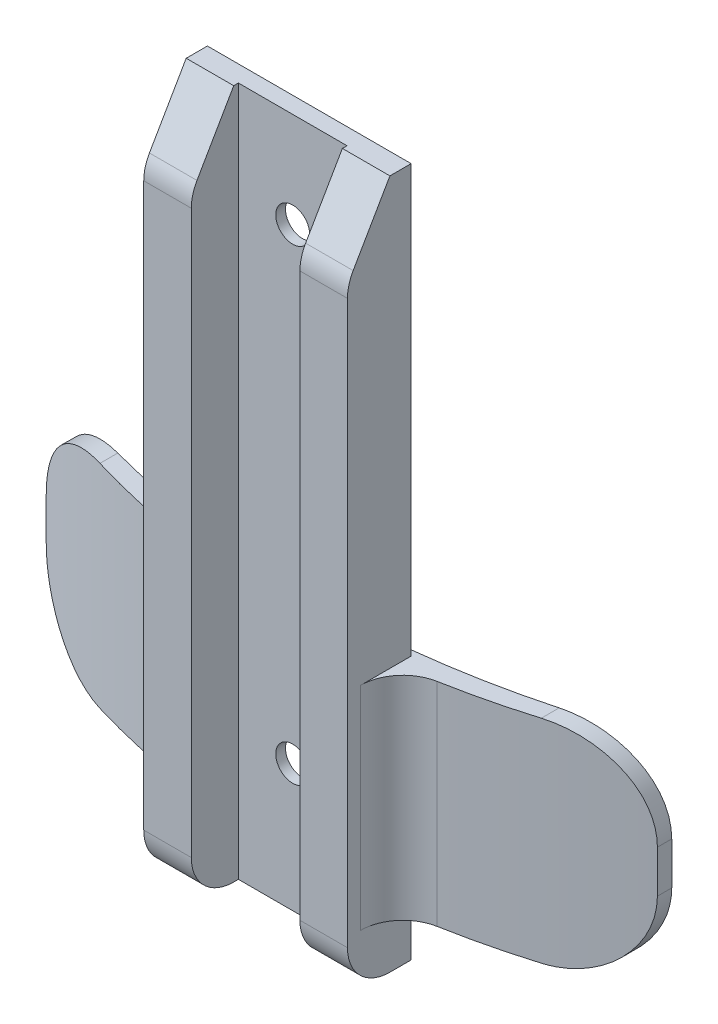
ISO-10303-21;
HEADER;
FILE_DESCRIPTION(('STEP AP214'),'2;1');
FILE_NAME('part.step','',(''),(''),'','','');
FILE_SCHEMA(('AUTOMOTIVE_DESIGN { 1 0 10303 214 1 1 1 1 }'));
ENDSEC;
DATA;
#1=APPLICATION_CONTEXT('core data for automotive mechanical design processes');
#2=APPLICATION_PROTOCOL_DEFINITION('international standard','automotive_design',2000,#1);
#3=PRODUCT_CONTEXT('',#1,'mechanical');
#4=PRODUCT('Part','Part','',(#3));
#5=PRODUCT_RELATED_PRODUCT_CATEGORY('part','',(#4));
#6=PRODUCT_DEFINITION_FORMATION('','',#4);
#7=PRODUCT_DEFINITION_CONTEXT('part definition',#1,'design');
#8=PRODUCT_DEFINITION('design','',#6,#7);
#9=PRODUCT_DEFINITION_SHAPE('','',#8);
#10=(LENGTH_UNIT() NAMED_UNIT(*) SI_UNIT(.MILLI.,.METRE.));
#11=(NAMED_UNIT(*) PLANE_ANGLE_UNIT() SI_UNIT($,.RADIAN.));
#12=(NAMED_UNIT(*) SI_UNIT($,.STERADIAN.) SOLID_ANGLE_UNIT());
#13=UNCERTAINTY_MEASURE_WITH_UNIT(LENGTH_MEASURE(1.E-05),#10,'distance_accuracy_value','');
#14=(GEOMETRIC_REPRESENTATION_CONTEXT(3) GLOBAL_UNCERTAINTY_ASSIGNED_CONTEXT((#13)) GLOBAL_UNIT_ASSIGNED_CONTEXT((#10,
#11,#12)) REPRESENTATION_CONTEXT('',''));
#15=CARTESIAN_POINT('',(0.,0.,0.));
#16=DIRECTION('',(0.,0.,1.));
#17=DIRECTION('',(1.,0.,0.));
#18=AXIS2_PLACEMENT_3D('',#15,#16,#17);
#19=CARTESIAN_POINT('',(-4.064,46.0375,-7.58825));
#20=DIRECTION('',(0.,0.,1.));
#21=DIRECTION('',(1.,0.,0.));
#22=AXIS2_PLACEMENT_3D('',#19,#20,#21);
#23=CYLINDRICAL_SURFACE('',#22,1.27);
#24=CARTESIAN_POINT('',(-4.064,46.0375,0.));
#25=DIRECTION('',(0.,0.,1.));
#26=DIRECTION('',(1.,0.,0.));
#27=AXIS2_PLACEMENT_3D('',#24,#25,#26);
#28=CIRCLE('',#27,1.27);
#29=CARTESIAN_POINT('',(-2.794,46.0375,0.));
#30=VERTEX_POINT('',#29);
#31=EDGE_CURVE('E223',#30,#30,#28,.T.);
#32=ORIENTED_EDGE('',*,*,#31,.T.);
#33=EDGE_LOOP('',(#32));
#34=FACE_BOUND('',#33,.T.);
#35=CARTESIAN_POINT('',(-4.064,46.0375,-0.730249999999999));
#36=DIRECTION('',(0.,0.,1.));
#37=DIRECTION('',(1.,0.,0.));
#38=AXIS2_PLACEMENT_3D('',#35,#36,#37);
#39=CIRCLE('',#38,1.27);
#40=CARTESIAN_POINT('',(-2.794,46.0375,-0.730249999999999));
#41=VERTEX_POINT('',#40);
#42=EDGE_CURVE('E604',#41,#41,#39,.F.);
#43=ORIENTED_EDGE('',*,*,#42,.T.);
#44=EDGE_LOOP('',(#43));
#45=FACE_BOUND('',#44,.T.);
#46=ADVANCED_FACE('F17',(#34,#45),#23,.F.);
#47=CARTESIAN_POINT('',(-4.064,46.83125,0.34925));
#48=DIRECTION('',(1.,0.,0.));
#49=DIRECTION('',(0.,0.,-1.));
#50=AXIS2_PLACEMENT_3D('',#47,#48,#49);
#51=CYLINDRICAL_SURFACE('',#50,3.175);
#52=CARTESIAN_POINT('',(0.,46.83125,0.34925));
#53=DIRECTION('',(1.,0.,0.));
#54=DIRECTION('',(0.,0.,-1.));
#55=AXIS2_PLACEMENT_3D('',#52,#53,#54);
#56=CIRCLE('',#55,3.175);
#57=CARTESIAN_POINT('',(0.,48.41875,3.0988806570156));
#58=VERTEX_POINT('',#57);
#59=CARTESIAN_POINT('',(0.,46.83125,3.52425));
#60=VERTEX_POINT('',#59);
#61=EDGE_CURVE('E260',#58,#60,#56,.T.);
#62=ORIENTED_EDGE('',*,*,#61,.T.);
#63=DIRECTION('',(1.,0.,0.));
#64=VECTOR('',#63,1.);
#65=CARTESIAN_POINT('',(-4.064,46.83125,3.52425));
#66=LINE('',#65,#64);
#67=CARTESIAN_POINT('',(3.556,46.83125,3.52425));
#68=VERTEX_POINT('',#67);
#69=EDGE_CURVE('E253',#68,#60,#66,.F.);
#70=ORIENTED_EDGE('',*,*,#69,.F.);
#71=CARTESIAN_POINT('',(3.556,46.83125,0.34925));
#72=DIRECTION('',(1.,0.,0.));
#73=DIRECTION('',(0.,0.,-1.));
#74=AXIS2_PLACEMENT_3D('',#71,#72,#73);
#75=CIRCLE('',#74,3.175);
#76=CARTESIAN_POINT('',(3.556,48.41875,3.09888065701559));
#77=VERTEX_POINT('',#76);
#78=EDGE_CURVE('E22',#68,#77,#75,.F.);
#79=ORIENTED_EDGE('',*,*,#78,.T.);
#80=DIRECTION('',(1.,0.,0.));
#81=VECTOR('',#80,1.);
#82=CARTESIAN_POINT('',(-4.064,48.41875,3.0988806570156));
#83=LINE('',#82,#81);
#84=EDGE_CURVE('E242',#77,#58,#83,.F.);
#85=ORIENTED_EDGE('',*,*,#84,.T.);
#86=EDGE_LOOP('',(#62,#70,#79,#85));
#87=FACE_BOUND('',#86,.T.);
#88=ADVANCED_FACE('F432',(#87),#51,.T.);
#89=CARTESIAN_POINT('',(0.,1.5875,3.52425));
#90=DIRECTION('',(1.,0.,0.));
#91=DIRECTION('',(0.,0.,-1.));
#92=AXIS2_PLACEMENT_3D('',#89,#90,#91);
#93=PLANE('',#92);
#94=ORIENTED_EDGE('',*,*,#61,.F.);
#95=DIRECTION('',(0.,0.866025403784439,-0.5));
#96=VECTOR('',#95,1.);
#97=CARTESIAN_POINT('',(0.,53.18125,0.34925));
#98=LINE('',#97,#96);
#99=CARTESIAN_POINT('',(0.,53.18125,0.34925));
#100=VERTEX_POINT('',#99);
#101=EDGE_CURVE('E251',#58,#100,#98,.T.);
#102=ORIENTED_EDGE('',*,*,#101,.T.);
#103=DIRECTION('',(0.,0.,-1.));
#104=VECTOR('',#103,1.);
#105=CARTESIAN_POINT('',(0.,53.18125,3.52425));
#106=LINE('',#105,#104);
#107=CARTESIAN_POINT('',(0.,53.18125,0.));
#108=VERTEX_POINT('',#107);
#109=EDGE_CURVE('E213',#108,#100,#106,.F.);
#110=ORIENTED_EDGE('',*,*,#109,.F.);
#111=DIRECTION('',(0.,1.,0.));
#112=VECTOR('',#111,1.);
#113=CARTESIAN_POINT('',(0.,56.7055,0.));
#114=LINE('',#113,#112);
#115=CARTESIAN_POINT('',(0.,1.5875,0.));
#116=VERTEX_POINT('',#115);
#117=EDGE_CURVE('E216',#108,#116,#114,.F.);
#118=ORIENTED_EDGE('',*,*,#117,.T.);
#119=DIRECTION('',(0.,0.,-1.));
#120=VECTOR('',#119,1.);
#121=CARTESIAN_POINT('',(0.,1.5875,3.52425));
#122=LINE('',#121,#120);
#123=CARTESIAN_POINT('',(0.,1.5875,0.34925));
#124=VERTEX_POINT('',#123);
#125=EDGE_CURVE('E201',#124,#116,#122,.T.);
#126=ORIENTED_EDGE('',*,*,#125,.F.);
#127=CARTESIAN_POINT('',(0.,4.7625,0.34925));
#128=DIRECTION('',(-1.,0.,0.));
#129=DIRECTION('',(0.,0.,1.));
#130=AXIS2_PLACEMENT_3D('',#127,#128,#129);
#131=CIRCLE('',#130,3.175);
#132=CARTESIAN_POINT('',(0.,4.7625,3.52425));
#133=VERTEX_POINT('',#132);
#134=EDGE_CURVE('E564',#133,#124,#131,.F.);
#135=ORIENTED_EDGE('',*,*,#134,.F.);
#136=DIRECTION('',(0.,1.,0.));
#137=VECTOR('',#136,1.);
#138=CARTESIAN_POINT('',(0.,27.384375,3.52425));
#139=LINE('',#138,#137);
#140=EDGE_CURVE('E256',#60,#133,#139,.F.);
#141=ORIENTED_EDGE('',*,*,#140,.F.);
#142=EDGE_LOOP('',(#94,#102,#110,#118,#126,#135,#141));
#143=FACE_BOUND('',#142,.T.);
#144=ADVANCED_FACE('F217',(#143),#93,.F.);
#145=CARTESIAN_POINT('',(-4.064,46.0375,-0.730249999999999));
#146=DIRECTION('',(0.,0.,1.));
#147=DIRECTION('',(1.,0.,0.));
#148=AXIS2_PLACEMENT_3D('',#145,#146,#147);
#149=PLANE('',#148);
#150=ORIENTED_EDGE('',*,*,#42,.F.);
#151=EDGE_LOOP('',(#150));
#152=FACE_BOUND('',#151,.T.);
#153=CARTESIAN_POINT('',(-4.064,46.0375,-0.730249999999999));
#154=DIRECTION('',(0.,0.,1.));
#155=DIRECTION('',(1.,0.,0.));
#156=AXIS2_PLACEMENT_3D('',#153,#154,#155);
#157=CIRCLE('',#156,2.54);
#158=CARTESIAN_POINT('',(-1.524,46.0375,-0.730249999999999));
#159=VERTEX_POINT('',#158);
#160=EDGE_CURVE('E559',#159,#159,#157,.F.);
#161=ORIENTED_EDGE('',*,*,#160,.T.);
#162=EDGE_LOOP('',(#161));
#163=FACE_BOUND('',#162,.T.);
#164=ADVANCED_FACE('F425',(#152,#163),#149,.F.);
#165=CARTESIAN_POINT('',(-4.064,46.83125,0.34925));
#166=DIRECTION('',(1.,0.,0.));
#167=DIRECTION('',(0.,0.,-1.));
#168=AXIS2_PLACEMENT_3D('',#165,#166,#167);
#169=CYLINDRICAL_SURFACE('',#168,3.175);
#170=CARTESIAN_POINT('',(-11.684,46.83125,0.34925));
#171=DIRECTION('',(1.,0.,0.));
#172=DIRECTION('',(0.,0.,-1.));
#173=AXIS2_PLACEMENT_3D('',#170,#171,#172);
#174=CIRCLE('',#173,3.175);
#175=CARTESIAN_POINT('',(-11.684,48.41875,3.09888065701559));
#176=VERTEX_POINT('',#175);
#177=CARTESIAN_POINT('',(-11.684,46.83125,3.52425));
#178=VERTEX_POINT('',#177);
#179=EDGE_CURVE('E602',#176,#178,#174,.T.);
#180=ORIENTED_EDGE('',*,*,#179,.T.);
#181=DIRECTION('',(1.,0.,0.));
#182=VECTOR('',#181,1.);
#183=CARTESIAN_POINT('',(-4.064,46.83125,3.52425));
#184=LINE('',#183,#182);
#185=CARTESIAN_POINT('',(-8.128,46.83125,3.52425));
#186=VERTEX_POINT('',#185);
#187=EDGE_CURVE('E231',#186,#178,#184,.F.);
#188=ORIENTED_EDGE('',*,*,#187,.F.);
#189=CARTESIAN_POINT('',(-8.128,46.83125,0.34925));
#190=DIRECTION('',(1.,0.,0.));
#191=DIRECTION('',(0.,0.,-1.));
#192=AXIS2_PLACEMENT_3D('',#189,#190,#191);
#193=CIRCLE('',#192,3.175);
#194=CARTESIAN_POINT('',(-8.128,48.41875,3.0988806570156));
#195=VERTEX_POINT('',#194);
#196=EDGE_CURVE('E600',#186,#195,#193,.F.);
#197=ORIENTED_EDGE('',*,*,#196,.T.);
#198=DIRECTION('',(1.,0.,0.));
#199=VECTOR('',#198,1.);
#200=CARTESIAN_POINT('',(-4.064,48.41875,3.0988806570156));
#201=LINE('',#200,#199);
#202=EDGE_CURVE('E535',#195,#176,#201,.F.);
#203=ORIENTED_EDGE('',*,*,#202,.T.);
#204=EDGE_LOOP('',(#180,#188,#197,#203));
#205=FACE_BOUND('',#204,.T.);
#206=ADVANCED_FACE('F421',(#205),#169,.T.);
#207=CARTESIAN_POINT('',(-8.128,56.7055,3.52425));
#208=DIRECTION('',(-1.,0.,0.));
#209=DIRECTION('',(0.,0.,1.));
#210=AXIS2_PLACEMENT_3D('',#207,#208,#209);
#211=PLANE('',#210);
#212=ORIENTED_EDGE('',*,*,#196,.F.);
#213=DIRECTION('',(0.,1.,0.));
#214=VECTOR('',#213,1.);
#215=CARTESIAN_POINT('',(-8.128,27.384375,3.52425));
#216=LINE('',#215,#214);
#217=CARTESIAN_POINT('',(-8.128,4.7625,3.52425));
#218=VERTEX_POINT('',#217);
#219=EDGE_CURVE('E228',#218,#186,#216,.T.);
#220=ORIENTED_EDGE('',*,*,#219,.F.);
#221=CARTESIAN_POINT('',(-8.128,4.7625,0.34925));
#222=DIRECTION('',(-1.,0.,0.));
#223=DIRECTION('',(0.,0.,1.));
#224=AXIS2_PLACEMENT_3D('',#221,#222,#223);
#225=CIRCLE('',#224,3.175);
#226=CARTESIAN_POINT('',(-8.128,1.5875,0.34925));
#227=VERTEX_POINT('',#226);
#228=EDGE_CURVE('E522',#227,#218,#225,.T.);
#229=ORIENTED_EDGE('',*,*,#228,.F.);
#230=DIRECTION('',(0.,0.,-1.));
#231=VECTOR('',#230,1.);
#232=CARTESIAN_POINT('',(-8.128,1.5875,3.52425));
#233=LINE('',#232,#231);
#234=CARTESIAN_POINT('',(-8.128,1.5875,0.));
#235=VERTEX_POINT('',#234);
#236=EDGE_CURVE('E247',#235,#227,#233,.F.);
#237=ORIENTED_EDGE('',*,*,#236,.F.);
#238=DIRECTION('',(0.,1.,0.));
#239=VECTOR('',#238,1.);
#240=CARTESIAN_POINT('',(-8.128,56.7055,0.));
#241=LINE('',#240,#239);
#242=CARTESIAN_POINT('',(-8.128,53.18125,0.));
#243=VERTEX_POINT('',#242);
#244=EDGE_CURVE('E222',#235,#243,#241,.T.);
#245=ORIENTED_EDGE('',*,*,#244,.T.);
#246=DIRECTION('',(0.,0.,1.));
#247=VECTOR('',#246,1.);
#248=CARTESIAN_POINT('',(-8.128,53.18125,3.52425));
#249=LINE('',#248,#247);
#250=CARTESIAN_POINT('',(-8.128,53.18125,0.34925));
#251=VERTEX_POINT('',#250);
#252=EDGE_CURVE('E248',#251,#243,#249,.F.);
#253=ORIENTED_EDGE('',*,*,#252,.F.);
#254=DIRECTION('',(0.,0.866025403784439,-0.5));
#255=VECTOR('',#254,1.);
#256=CARTESIAN_POINT('',(-8.128,53.18125,0.34925));
#257=LINE('',#256,#255);
#258=EDGE_CURVE('E538',#251,#195,#257,.F.);
#259=ORIENTED_EDGE('',*,*,#258,.T.);
#260=EDGE_LOOP('',(#212,#220,#229,#237,#245,#253,#259));
#261=FACE_BOUND('',#260,.T.);
#262=ADVANCED_FACE('F418',(#261),#211,.F.);
#263=CARTESIAN_POINT('',(0.,56.7055,0.));
#264=DIRECTION('',(0.,0.,-1.));
#265=DIRECTION('',(-1.,0.,0.));
#266=AXIS2_PLACEMENT_3D('',#263,#264,#265);
#267=PLANE('',#266);
#268=ORIENTED_EDGE('',*,*,#244,.F.);
#269=DIRECTION('',(1.,0.,0.));
#270=VECTOR('',#269,1.);
#271=CARTESIAN_POINT('',(-4.064,1.5875,0.));
#272=LINE('',#271,#270);
#273=EDGE_CURVE('E205',#116,#235,#272,.F.);
#274=ORIENTED_EDGE('',*,*,#273,.F.);
#275=ORIENTED_EDGE('',*,*,#117,.F.);
#276=DIRECTION('',(1.,0.,0.));
#277=VECTOR('',#276,1.);
#278=CARTESIAN_POINT('',(-4.064,53.18125,0.));
#279=LINE('',#278,#277);
#280=EDGE_CURVE('E245',#243,#108,#279,.T.);
#281=ORIENTED_EDGE('',*,*,#280,.F.);
#282=EDGE_LOOP('',(#268,#274,#275,#281));
#283=FACE_BOUND('',#282,.T.);
#284=CARTESIAN_POINT('',(-4.064,11.1125,0.));
#285=DIRECTION('',(0.,0.,1.));
#286=DIRECTION('',(1.,0.,0.));
#287=AXIS2_PLACEMENT_3D('',#284,#285,#286);
#288=CIRCLE('',#287,1.27);
#289=CARTESIAN_POINT('',(-2.794,11.1125,0.));
#290=VERTEX_POINT('',#289);
#291=EDGE_CURVE('E525',#290,#290,#288,.F.);
#292=ORIENTED_EDGE('',*,*,#291,.T.);
#293=EDGE_LOOP('',(#292));
#294=FACE_BOUND('',#293,.T.);
#295=ORIENTED_EDGE('',*,*,#31,.F.);
#296=EDGE_LOOP('',(#295));
#297=FACE_BOUND('',#296,.T.);
#298=ADVANCED_FACE('F225',(#283,#294,#297),#267,.F.);
#299=CARTESIAN_POINT('',(-4.064,53.18125,0.34925));
#300=DIRECTION('',(0.,-0.5,-0.866025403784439));
#301=DIRECTION('',(0.,0.866025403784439,-0.5));
#302=AXIS2_PLACEMENT_3D('',#299,#300,#301);
#303=PLANE('',#302);
#304=ORIENTED_EDGE('',*,*,#84,.F.);
#305=DIRECTION('',(0.,-0.866025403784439,0.5));
#306=VECTOR('',#305,1.);
#307=CARTESIAN_POINT('',(3.556,53.18125,0.34925));
#308=LINE('',#307,#306);
#309=CARTESIAN_POINT('',(3.556,53.18125,0.34925));
#310=VERTEX_POINT('',#309);
#311=EDGE_CURVE('E594',#310,#77,#308,.T.);
#312=ORIENTED_EDGE('',*,*,#311,.F.);
#313=DIRECTION('',(1.,0.,0.));
#314=VECTOR('',#313,1.);
#315=CARTESIAN_POINT('',(-4.064,53.18125,0.34925));
#316=LINE('',#315,#314);
#317=EDGE_CURVE('E183',#100,#310,#316,.T.);
#318=ORIENTED_EDGE('',*,*,#317,.F.);
#319=ORIENTED_EDGE('',*,*,#101,.F.);
#320=EDGE_LOOP('',(#304,#312,#318,#319));
#321=FACE_BOUND('',#320,.T.);
#322=ADVANCED_FACE('F411',(#321),#303,.F.);
#323=CARTESIAN_POINT('',(-4.064,27.384375,3.52425));
#324=DIRECTION('',(0.,0.,1.));
#325=DIRECTION('',(1.,0.,0.));
#326=AXIS2_PLACEMENT_3D('',#323,#324,#325);
#327=PLANE('',#326);
#328=ORIENTED_EDGE('',*,*,#140,.T.);
#329=DIRECTION('',(-1.,0.,0.));
#330=VECTOR('',#329,1.);
#331=CARTESIAN_POINT('',(-4.064,4.7625,3.52425));
#332=LINE('',#331,#330);
#333=CARTESIAN_POINT('',(3.556,4.7625,3.52425));
#334=VERTEX_POINT('',#333);
#335=EDGE_CURVE('E258',#334,#133,#332,.T.);
#336=ORIENTED_EDGE('',*,*,#335,.F.);
#337=DIRECTION('',(0.,1.,0.));
#338=VECTOR('',#337,1.);
#339=CARTESIAN_POINT('',(3.556,27.384375,3.52425));
#340=LINE('',#339,#338);
#341=EDGE_CURVE('E591',#68,#334,#340,.F.);
#342=ORIENTED_EDGE('',*,*,#341,.F.);
#343=ORIENTED_EDGE('',*,*,#69,.T.);
#344=EDGE_LOOP('',(#328,#336,#342,#343));
#345=FACE_BOUND('',#344,.T.);
#346=ADVANCED_FACE('F407',(#345),#327,.T.);
#347=CARTESIAN_POINT('',(-4.064,4.7625,0.34925));
#348=DIRECTION('',(-1.,0.,0.));
#349=DIRECTION('',(0.,0.,1.));
#350=AXIS2_PLACEMENT_3D('',#347,#348,#349);
#351=CYLINDRICAL_SURFACE('',#350,3.175);
#352=ORIENTED_EDGE('',*,*,#134,.T.);
#353=DIRECTION('',(1.,0.,0.));
#354=VECTOR('',#353,1.);
#355=CARTESIAN_POINT('',(-4.064,1.5875,0.34925));
#356=LINE('',#355,#354);
#357=CARTESIAN_POINT('',(3.556,1.5875,0.34925));
#358=VERTEX_POINT('',#357);
#359=EDGE_CURVE('E209',#358,#124,#356,.F.);
#360=ORIENTED_EDGE('',*,*,#359,.F.);
#361=CARTESIAN_POINT('',(3.556,4.7625,0.34925));
#362=DIRECTION('',(-1.,0.,0.));
#363=DIRECTION('',(0.,0.,1.));
#364=AXIS2_PLACEMENT_3D('',#361,#362,#363);
#365=CIRCLE('',#364,3.175);
#366=EDGE_CURVE('E589',#334,#358,#365,.F.);
#367=ORIENTED_EDGE('',*,*,#366,.F.);
#368=ORIENTED_EDGE('',*,*,#335,.T.);
#369=EDGE_LOOP('',(#352,#360,#367,#368));
#370=FACE_BOUND('',#369,.T.);
#371=ADVANCED_FACE('F403',(#370),#351,.T.);
#372=CARTESIAN_POINT('',(-4.064,46.0375,-1.23825));
#373=DIRECTION('',(0.,0.,1.));
#374=DIRECTION('',(1.,0.,0.));
#375=AXIS2_PLACEMENT_3D('',#372,#373,#374);
#376=CYLINDRICAL_SURFACE('',#375,2.54);
#377=ORIENTED_EDGE('',*,*,#160,.F.);
#378=EDGE_LOOP('',(#377));
#379=FACE_BOUND('',#378,.T.);
#380=CARTESIAN_POINT('',(-4.064,46.0375,-1.23825));
#381=DIRECTION('',(0.,0.,1.));
#382=DIRECTION('',(1.,0.,0.));
#383=AXIS2_PLACEMENT_3D('',#380,#381,#382);
#384=CIRCLE('',#383,2.54);
#385=CARTESIAN_POINT('',(-1.524,46.0375,-1.23825));
#386=VERTEX_POINT('',#385);
#387=EDGE_CURVE('E500',#386,#386,#384,.T.);
#388=ORIENTED_EDGE('',*,*,#387,.F.);
#389=EDGE_LOOP('',(#388));
#390=FACE_BOUND('',#389,.T.);
#391=ADVANCED_FACE('F400',(#379,#390),#376,.F.);
#392=CARTESIAN_POINT('',(-4.064,53.18125,3.52425));
#393=DIRECTION('',(0.,1.,0.));
#394=DIRECTION('',(0.,0.,1.));
#395=AXIS2_PLACEMENT_3D('',#392,#393,#394);
#396=PLANE('',#395);
#397=ORIENTED_EDGE('',*,*,#252,.T.);
#398=ORIENTED_EDGE('',*,*,#280,.T.);
#399=ORIENTED_EDGE('',*,*,#109,.T.);
#400=ORIENTED_EDGE('',*,*,#317,.T.);
#401=DIRECTION('',(0.,0.,-1.));
#402=VECTOR('',#401,1.);
#403=CARTESIAN_POINT('',(3.556,53.18125,3.52425));
#404=LINE('',#403,#402);
#405=CARTESIAN_POINT('',(3.556,53.18125,-1.23825));
#406=VERTEX_POINT('',#405);
#407=EDGE_CURVE('E501',#406,#310,#404,.F.);
#408=ORIENTED_EDGE('',*,*,#407,.F.);
#409=DIRECTION('',(-1.,0.,0.));
#410=VECTOR('',#409,1.);
#411=CARTESIAN_POINT('',(-4.064,53.18125,-1.23825));
#412=LINE('',#411,#410);
#413=CARTESIAN_POINT('',(-11.684,53.18125,-1.23825));
#414=VERTEX_POINT('',#413);
#415=EDGE_CURVE('E505',#414,#406,#412,.F.);
#416=ORIENTED_EDGE('',*,*,#415,.F.);
#417=DIRECTION('',(0.,0.,1.));
#418=VECTOR('',#417,1.);
#419=CARTESIAN_POINT('',(-11.684,53.18125,3.52425));
#420=LINE('',#419,#418);
#421=CARTESIAN_POINT('',(-11.684,53.18125,0.34925));
#422=VERTEX_POINT('',#421);
#423=EDGE_CURVE('E550',#414,#422,#420,.T.);
#424=ORIENTED_EDGE('',*,*,#423,.T.);
#425=DIRECTION('',(1.,0.,0.));
#426=VECTOR('',#425,1.);
#427=CARTESIAN_POINT('',(-4.064,53.18125,0.34925));
#428=LINE('',#427,#426);
#429=EDGE_CURVE('E539',#422,#251,#428,.T.);
#430=ORIENTED_EDGE('',*,*,#429,.T.);
#431=EDGE_LOOP('',(#397,#398,#399,#400,#408,#416,#424,#430));
#432=FACE_BOUND('',#431,.T.);
#433=ADVANCED_FACE('F397',(#432),#396,.T.);
#434=CARTESIAN_POINT('',(-4.064,1.5875,3.52425));
#435=DIRECTION('',(0.,-1.,0.));
#436=DIRECTION('',(0.,0.,-1.));
#437=AXIS2_PLACEMENT_3D('',#434,#435,#436);
#438=PLANE('',#437);
#439=ORIENTED_EDGE('',*,*,#125,.T.);
#440=ORIENTED_EDGE('',*,*,#273,.T.);
#441=ORIENTED_EDGE('',*,*,#236,.T.);
#442=DIRECTION('',(-1.,0.,0.));
#443=VECTOR('',#442,1.);
#444=CARTESIAN_POINT('',(-4.064,1.5875,0.349249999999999));
#445=LINE('',#444,#443);
#446=CARTESIAN_POINT('',(-11.684,1.5875,0.34925));
#447=VERTEX_POINT('',#446);
#448=EDGE_CURVE('E521',#447,#227,#445,.F.);
#449=ORIENTED_EDGE('',*,*,#448,.F.);
#450=DIRECTION('',(0.,0.,-1.));
#451=VECTOR('',#450,1.);
#452=CARTESIAN_POINT('',(-11.684,1.5875,3.52425));
#453=LINE('',#452,#451);
#454=CARTESIAN_POINT('',(-11.684,1.5875,-1.23825));
#455=VERTEX_POINT('',#454);
#456=EDGE_CURVE('E233',#447,#455,#453,.T.);
#457=ORIENTED_EDGE('',*,*,#456,.T.);
#458=DIRECTION('',(-1.,0.,0.));
#459=VECTOR('',#458,1.);
#460=CARTESIAN_POINT('',(-4.064,1.5875,-1.23825));
#461=LINE('',#460,#459);
#462=CARTESIAN_POINT('',(3.556,1.5875,-1.23825));
#463=VERTEX_POINT('',#462);
#464=EDGE_CURVE('E516',#463,#455,#461,.T.);
#465=ORIENTED_EDGE('',*,*,#464,.F.);
#466=DIRECTION('',(0.,0.,-1.));
#467=VECTOR('',#466,1.);
#468=CARTESIAN_POINT('',(3.556,1.5875,3.52425));
#469=LINE('',#468,#467);
#470=EDGE_CURVE('E510',#358,#463,#469,.T.);
#471=ORIENTED_EDGE('',*,*,#470,.F.);
#472=ORIENTED_EDGE('',*,*,#359,.T.);
#473=EDGE_LOOP('',(#439,#440,#441,#449,#457,#465,#471,#472));
#474=FACE_BOUND('',#473,.T.);
#475=ADVANCED_FACE('F203',(#474),#438,.T.);
#476=CARTESIAN_POINT('',(-4.064,27.384375,3.52425));
#477=DIRECTION('',(0.,0.,1.));
#478=DIRECTION('',(1.,0.,0.));
#479=AXIS2_PLACEMENT_3D('',#476,#477,#478);
#480=PLANE('',#479);
#481=DIRECTION('',(0.,1.,0.));
#482=VECTOR('',#481,1.);
#483=CARTESIAN_POINT('',(-11.684,27.384375,3.52425));
#484=LINE('',#483,#482);
#485=CARTESIAN_POINT('',(-11.684,4.7625,3.52425));
#486=VERTEX_POINT('',#485);
#487=EDGE_CURVE('E528',#486,#178,#484,.T.);
#488=ORIENTED_EDGE('',*,*,#487,.F.);
#489=DIRECTION('',(-1.,0.,0.));
#490=VECTOR('',#489,1.);
#491=CARTESIAN_POINT('',(-4.064,4.7625,3.52425));
#492=LINE('',#491,#490);
#493=EDGE_CURVE('E519',#218,#486,#492,.T.);
#494=ORIENTED_EDGE('',*,*,#493,.F.);
#495=ORIENTED_EDGE('',*,*,#219,.T.);
#496=ORIENTED_EDGE('',*,*,#187,.T.);
#497=EDGE_LOOP('',(#488,#494,#495,#496));
#498=FACE_BOUND('',#497,.T.);
#499=ADVANCED_FACE('F390',(#498),#480,.T.);
#500=CARTESIAN_POINT('',(-4.064,53.18125,0.34925));
#501=DIRECTION('',(0.,-0.5,-0.866025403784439));
#502=DIRECTION('',(0.,0.866025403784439,-0.5));
#503=AXIS2_PLACEMENT_3D('',#500,#501,#502);
#504=PLANE('',#503);
#505=ORIENTED_EDGE('',*,*,#202,.F.);
#506=ORIENTED_EDGE('',*,*,#258,.F.);
#507=ORIENTED_EDGE('',*,*,#429,.F.);
#508=DIRECTION('',(0.,0.866025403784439,-0.5));
#509=VECTOR('',#508,1.);
#510=CARTESIAN_POINT('',(-11.684,48.41875,3.09888065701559));
#511=LINE('',#510,#509);
#512=EDGE_CURVE('E495',#176,#422,#511,.T.);
#513=ORIENTED_EDGE('',*,*,#512,.F.);
#514=EDGE_LOOP('',(#505,#506,#507,#513));
#515=FACE_BOUND('',#514,.T.);
#516=ADVANCED_FACE('F386',(#515),#504,.F.);
#517=CARTESIAN_POINT('',(-4.064,4.7625,0.34925));
#518=DIRECTION('',(-1.,0.,0.));
#519=DIRECTION('',(0.,0.,1.));
#520=AXIS2_PLACEMENT_3D('',#517,#518,#519);
#521=CYLINDRICAL_SURFACE('',#520,3.175);
#522=CARTESIAN_POINT('',(-11.684,4.7625,0.34925));
#523=DIRECTION('',(-1.,0.,0.));
#524=DIRECTION('',(0.,0.,1.));
#525=AXIS2_PLACEMENT_3D('',#522,#523,#524);
#526=CIRCLE('',#525,3.175);
#527=EDGE_CURVE('E484',#447,#486,#526,.T.);
#528=ORIENTED_EDGE('',*,*,#527,.F.);
#529=ORIENTED_EDGE('',*,*,#448,.T.);
#530=ORIENTED_EDGE('',*,*,#228,.T.);
#531=ORIENTED_EDGE('',*,*,#493,.T.);
#532=EDGE_LOOP('',(#528,#529,#530,#531));
#533=FACE_BOUND('',#532,.T.);
#534=ADVANCED_FACE('F382',(#533),#521,.T.);
#535=CARTESIAN_POINT('',(-4.064,11.1125,-7.58825));
#536=DIRECTION('',(0.,0.,1.));
#537=DIRECTION('',(1.,0.,0.));
#538=AXIS2_PLACEMENT_3D('',#535,#536,#537);
#539=CYLINDRICAL_SURFACE('',#538,1.27);
#540=ORIENTED_EDGE('',*,*,#291,.F.);
#541=EDGE_LOOP('',(#540));
#542=FACE_BOUND('',#541,.T.);
#543=CARTESIAN_POINT('',(-4.064,11.1125,-0.730249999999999));
#544=DIRECTION('',(0.,0.,1.));
#545=DIRECTION('',(1.,0.,0.));
#546=AXIS2_PLACEMENT_3D('',#543,#544,#545);
#547=CIRCLE('',#546,1.27);
#548=CARTESIAN_POINT('',(-2.794,11.1125,-0.730249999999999));
#549=VERTEX_POINT('',#548);
#550=EDGE_CURVE('E481',#549,#549,#547,.F.);
#551=ORIENTED_EDGE('',*,*,#550,.T.);
#552=EDGE_LOOP('',(#551));
#553=FACE_BOUND('',#552,.T.);
#554=ADVANCED_FACE('F378',(#542,#553),#539,.F.);
#555=CARTESIAN_POINT('',(6.731,21.2725,2.55052294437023));
#556=DIRECTION('',(0.,-1.,0.));
#557=DIRECTION('',(0.,0.,-1.));
#558=AXIS2_PLACEMENT_3D('',#555,#556,#557);
#559=CYLINDRICAL_SURFACE('',#558,3.175);
#560=CARTESIAN_POINT('',(6.731,21.2725,2.55052294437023));
#561=DIRECTION('',(0.,-1.,0.));
#562=DIRECTION('',(0.,0.,-1.));
#563=AXIS2_PLACEMENT_3D('',#560,#561,#562);
#564=CIRCLE('',#563,3.175);
#565=CARTESIAN_POINT('',(6.16284210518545,21.2725,-0.573228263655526));
#566=VERTEX_POINT('',#565);
#567=CARTESIAN_POINT('',(3.556,21.2725,2.55052294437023));
#568=VERTEX_POINT('',#567);
#569=EDGE_CURVE('E639',#566,#568,#564,.F.);
#570=ORIENTED_EDGE('',*,*,#569,.T.);
#571=DIRECTION('',(0.,1.,0.));
#572=VECTOR('',#571,1.);
#573=CARTESIAN_POINT('',(3.556,27.384375,2.55052294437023));
#574=LINE('',#573,#572);
#575=CARTESIAN_POINT('',(3.556,5.3975,2.55052294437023));
#576=VERTEX_POINT('',#575);
#577=EDGE_CURVE('E508',#576,#568,#574,.T.);
#578=ORIENTED_EDGE('',*,*,#577,.F.);
#579=CARTESIAN_POINT('',(6.731,5.3975,2.55052294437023));
#580=DIRECTION('',(0.,-1.,0.));
#581=DIRECTION('',(0.,0.,-1.));
#582=AXIS2_PLACEMENT_3D('',#579,#580,#581);
#583=CIRCLE('',#582,3.175);
#584=CARTESIAN_POINT('',(6.16284210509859,5.3975,-0.573228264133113));
#585=VERTEX_POINT('',#584);
#586=EDGE_CURVE('E364',#585,#576,#583,.F.);
#587=ORIENTED_EDGE('',*,*,#586,.F.);
#588=DIRECTION('',(0.,-1.,0.));
#589=VECTOR('',#588,1.);
#590=CARTESIAN_POINT('',(6.1628421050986,21.2725,-0.57322826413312));
#591=LINE('',#590,#589);
#592=EDGE_CURVE('E498',#566,#585,#591,.T.);
#593=ORIENTED_EDGE('',*,*,#592,.F.);
#594=EDGE_LOOP('',(#570,#578,#587,#593));
#595=FACE_BOUND('',#594,.T.);
#596=ADVANCED_FACE('F375',(#595),#559,.F.);
#597=CARTESIAN_POINT('',(3.556,27.384375,3.52425));
#598=DIRECTION('',(1.,0.,0.));
#599=DIRECTION('',(0.,0.,-1.));
#600=AXIS2_PLACEMENT_3D('',#597,#598,#599);
#601=PLANE('',#600);
#602=DIRECTION('',(0.,1.,0.));
#603=VECTOR('',#602,1.);
#604=CARTESIAN_POINT('',(3.556,27.384375,-1.23825));
#605=LINE('',#604,#603);
#606=CARTESIAN_POINT('',(3.556,21.2725,-1.23825));
#607=VERTEX_POINT('',#606);
#608=EDGE_CURVE('E502',#406,#607,#605,.F.);
#609=ORIENTED_EDGE('',*,*,#608,.F.);
#610=ORIENTED_EDGE('',*,*,#407,.T.);
#611=ORIENTED_EDGE('',*,*,#311,.T.);
#612=ORIENTED_EDGE('',*,*,#78,.F.);
#613=ORIENTED_EDGE('',*,*,#341,.T.);
#614=ORIENTED_EDGE('',*,*,#366,.T.);
#615=ORIENTED_EDGE('',*,*,#470,.T.);
#616=DIRECTION('',(0.,1.,0.));
#617=VECTOR('',#616,1.);
#618=CARTESIAN_POINT('',(3.556,27.384375,-1.23825));
#619=LINE('',#618,#617);
#620=CARTESIAN_POINT('',(3.556,5.3975,-1.23825));
#621=VERTEX_POINT('',#620);
#622=EDGE_CURVE('E513',#621,#463,#619,.F.);
#623=ORIENTED_EDGE('',*,*,#622,.F.);
#624=DIRECTION('',(0.,0.,-1.));
#625=VECTOR('',#624,1.);
#626=CARTESIAN_POINT('',(3.556,5.3975,-64.73825));
#627=LINE('',#626,#625);
#628=EDGE_CURVE('E629',#576,#621,#627,.T.);
#629=ORIENTED_EDGE('',*,*,#628,.F.);
#630=ORIENTED_EDGE('',*,*,#577,.T.);
#631=DIRECTION('',(0.,0.,-1.));
#632=VECTOR('',#631,1.);
#633=CARTESIAN_POINT('',(3.556,21.2725,-64.73825));
#634=LINE('',#633,#632);
#635=EDGE_CURVE('E647',#568,#607,#634,.T.);
#636=ORIENTED_EDGE('',*,*,#635,.T.);
#637=EDGE_LOOP('',(#609,#610,#611,#612,#613,#614,#615,#623,#629,#630,#636));
#638=FACE_BOUND('',#637,.T.);
#639=ADVANCED_FACE('F370',(#638),#601,.T.);
#640=CARTESIAN_POINT('',(-4.064,21.2725,-56.80075));
#641=DIRECTION('',(0.,-1.,0.));
#642=DIRECTION('',(0.,0.,-1.));
#643=AXIS2_PLACEMENT_3D('',#640,#641,#642);
#644=CYLINDRICAL_SURFACE('',#643,57.15);
#645=CARTESIAN_POINT('',(-4.064,5.3975,-56.80075));
#646=DIRECTION('',(0.,-1.,0.));
#647=DIRECTION('',(0.,0.,-1.));
#648=AXIS2_PLACEMENT_3D('',#645,#646,#647);
#649=CIRCLE('',#648,57.15);
#650=CARTESIAN_POINT('',(12.446,5.3975,-2.08747555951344));
#651=VERTEX_POINT('',#650);
#652=EDGE_CURVE('E792',#651,#585,#649,.T.);
#653=ORIENTED_EDGE('',*,*,#652,.F.);
#654=CARTESIAN_POINT('',(18.796,11.7475,-4.42190980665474));
#655=CARTESIAN_POINT('',(18.7960262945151,11.5787387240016,-4.42192773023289));
#656=CARTESIAN_POINT('',(18.7892735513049,11.4099874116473,-4.41897432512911));
#657=CARTESIAN_POINT('',(18.7624044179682,11.0737985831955,-4.40725654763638));
#658=CARTESIAN_POINT('',(18.7422915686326,10.9063607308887,-4.39849371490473));
#659=CARTESIAN_POINT('',(18.6889849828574,10.5745529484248,-4.37532711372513));
#660=CARTESIAN_POINT('',(18.65583483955,10.4101746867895,-4.36094214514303));
#661=CARTESIAN_POINT('',(18.5768100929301,10.0850782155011,-4.32677472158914));
#662=CARTESIAN_POINT('',(18.5309350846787,9.92436012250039,-4.30699209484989));
#663=CARTESIAN_POINT('',(18.4269639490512,9.60780244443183,-4.26236183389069));
#664=CARTESIAN_POINT('',(18.3688776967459,9.45195903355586,-4.23751829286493));
#665=CARTESIAN_POINT('',(18.2409906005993,9.14594360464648,-4.18312251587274));
#666=CARTESIAN_POINT('',(18.1711853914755,8.99577372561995,-4.15356852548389));
#667=CARTESIAN_POINT('',(18.0204810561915,8.70202538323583,-4.09017349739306));
#668=CARTESIAN_POINT('',(17.9395800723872,8.55844802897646,-4.05633174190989));
#669=CARTESIAN_POINT('',(17.7673292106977,8.27864410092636,-3.98480293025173));
#670=CARTESIAN_POINT('',(17.6759753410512,8.14242036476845,-3.94711440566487));
#671=CARTESIAN_POINT('',(17.4796974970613,7.87280281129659,-3.86679803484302));
#672=CARTESIAN_POINT('',(17.3743783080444,7.73973704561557,-3.82403335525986));
#673=CARTESIAN_POINT('',(17.154004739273,7.48301284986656,-3.73538544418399));
#674=CARTESIAN_POINT('',(17.0389468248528,7.35935786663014,-3.68950108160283));
#675=CARTESIAN_POINT('',(16.6803711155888,7.00346644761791,-3.54796239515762));
#676=CARTESIAN_POINT('',(16.4233273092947,6.78613420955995,-3.44837122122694));
#677=CARTESIAN_POINT('',(15.859556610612,6.38096720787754,-3.23516521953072));
#678=CARTESIAN_POINT('',(15.5505455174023,6.19658888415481,-3.12105914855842));
#679=CARTESIAN_POINT('',(14.9067388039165,5.88273722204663,-2.89017254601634));
#680=CARTESIAN_POINT('',(14.5719456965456,5.75325854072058,-2.77339227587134));
#681=CARTESIAN_POINT('',(13.9400161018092,5.56844420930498,-2.55989196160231));
#682=CARTESIAN_POINT('',(13.6454410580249,5.50455290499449,-2.46295579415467));
#683=CARTESIAN_POINT('',(13.1985356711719,5.440451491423,-2.32000195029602));
#684=CARTESIAN_POINT('',(13.0487408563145,5.42437363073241,-2.27276333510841));
#685=CARTESIAN_POINT('',(12.7480427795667,5.40289703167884,-2.17930214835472));
#686=CARTESIAN_POINT('',(12.5971393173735,5.39750027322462,-2.13307976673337));
#687=CARTESIAN_POINT('',(12.446,5.3975,-2.08747555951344));
#688=B_SPLINE_CURVE_WITH_KNOTS('',3,(#654,#655,#656,#657,#658,#659,#660,#661,#662,#663,#664,
#665,#666,#667,#668,#669,#670,#671,#672,#673,#674,#675,#676,#677,#678,#679,#680,#681,#682,#683,
#684,#685,#686,#687),.UNSPECIFIED.,.F.,.F.,(4,2,2,2,2,2,2,2,2,2,2,2,2,2,2,2,4),(0.,
0.506107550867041,1.01208102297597,1.51637684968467,2.02068872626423,2.52459433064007,
3.02868805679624,3.53286628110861,4.03723768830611,4.56166968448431,5.08629284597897,
6.13489811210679,7.26251367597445,8.39001947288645,9.33686822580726,9.81020486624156,
10.2836292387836),.UNSPECIFIED.);
#689=CARTESIAN_POINT('',(18.796,11.7475,-4.42190980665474));
#690=VERTEX_POINT('',#689);
#691=EDGE_CURVE('E351',#690,#651,#688,.T.);
#692=ORIENTED_EDGE('',*,*,#691,.F.);
#693=DIRECTION('',(0.,1.,0.));
#694=VECTOR('',#693,1.);
#695=CARTESIAN_POINT('',(18.796,21.2725,-4.42190980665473));
#696=LINE('',#695,#694);
#697=CARTESIAN_POINT('',(18.796,14.9225,-4.42190980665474));
#698=VERTEX_POINT('',#697);
#699=EDGE_CURVE('E477',#690,#698,#696,.T.);
#700=ORIENTED_EDGE('',*,*,#699,.T.);
#701=CARTESIAN_POINT('',(12.446,21.2725,-2.08747555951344));
#702=CARTESIAN_POINT('',(12.6339865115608,21.2725143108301,-2.14419086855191));
#703=CARTESIAN_POINT('',(12.8216609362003,21.2641531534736,-2.20188975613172));
#704=CARTESIAN_POINT('',(13.1950520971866,21.2309464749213,-2.31877520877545));
#705=CARTESIAN_POINT('',(13.3807690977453,21.2061032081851,-2.37796156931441));
#706=CARTESIAN_POINT('',(13.7489018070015,21.1402098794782,-2.49733808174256));
#707=CARTESIAN_POINT('',(13.931318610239,21.0991652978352,-2.55752788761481));
#708=CARTESIAN_POINT('',(14.2916774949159,21.0012198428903,-2.67840986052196));
#709=CARTESIAN_POINT('',(14.4696194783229,20.9443186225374,-2.73910203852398));
#710=CARTESIAN_POINT('',(14.8197995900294,20.8150720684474,-2.86042228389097));
#711=CARTESIAN_POINT('',(14.9920383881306,20.7427285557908,-2.92105035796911));
#712=CARTESIAN_POINT('',(15.3297212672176,20.5830253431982,-3.04167418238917));
#713=CARTESIAN_POINT('',(15.4951629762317,20.4956604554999,-3.10166970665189));
#714=CARTESIAN_POINT('',(15.8180098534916,20.306462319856,-3.22036401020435));
#715=CARTESIAN_POINT('',(15.9754163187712,20.20463141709,-3.27906299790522));
#716=CARTESIAN_POINT('',(16.2810746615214,19.987072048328,-3.39450384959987));
#717=CARTESIAN_POINT('',(16.4293268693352,19.8713440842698,-3.45124578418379));
#718=CARTESIAN_POINT('',(16.7152064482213,19.6269296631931,-3.56194344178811));
#719=CARTESIAN_POINT('',(16.8528580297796,19.4982743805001,-3.61590541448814));
#720=CARTESIAN_POINT('',(17.1167391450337,19.2285739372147,-3.72044360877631));
#721=CARTESIAN_POINT('',(17.2429731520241,19.087533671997,-3.77102115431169));
#722=CARTESIAN_POINT('',(17.4829791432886,18.793845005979,-3.86808564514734));
#723=CARTESIAN_POINT('',(17.5967483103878,18.6411939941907,-3.91457166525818));
#724=CARTESIAN_POINT('',(17.8106708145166,18.3253199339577,-4.00269449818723));
#725=CARTESIAN_POINT('',(17.9108253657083,18.1620978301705,-4.04433174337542));
#726=CARTESIAN_POINT('',(18.0914082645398,17.8353664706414,-4.11992384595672));
#727=CARTESIAN_POINT('',(18.1726124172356,17.672354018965,-4.15417308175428));
#728=CARTESIAN_POINT('',(18.3210335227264,17.3390578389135,-4.21710923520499));
#729=CARTESIAN_POINT('',(18.388252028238,17.1687749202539,-4.24579677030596));
#730=CARTESIAN_POINT('',(18.5078595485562,16.8224649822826,-4.29705590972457));
#731=CARTESIAN_POINT('',(18.5602701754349,16.6464467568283,-4.31963642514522));
#732=CARTESIAN_POINT('',(18.6497402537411,16.2899314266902,-4.35829705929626));
#733=CARTESIAN_POINT('',(18.6868070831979,16.1094365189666,-4.37438030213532));
#734=CARTESIAN_POINT('',(18.7425679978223,15.7615186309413,-4.39861415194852));
#735=CARTESIAN_POINT('',(18.7625950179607,15.5943481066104,-4.407339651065));
#736=CARTESIAN_POINT('',(18.7893149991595,15.2589565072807,-4.41899238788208));
#737=CARTESIAN_POINT('',(18.7960246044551,15.0907370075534,-4.42192686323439));
#738=CARTESIAN_POINT('',(18.796,14.9225,-4.42190980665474));
#739=B_SPLINE_CURVE_WITH_KNOTS('',3,(#701,#702,#703,#704,#705,#706,#707,#708,#709,#710,#711,
#712,#713,#714,#715,#716,#717,#718,#719,#720,#721,#722,#723,#724,#725,#726,#727,#728,#729,#730,
#731,#732,#733,#734,#735,#736,#737,#738),.UNSPECIFIED.,.F.,.F.,(4,2,2,2,2,2,2,2,2,2,2,2,2,2,2,2,
2,2,4),(0.,0.588865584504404,1.1776506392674,1.76623669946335,2.35483564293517,2.94336521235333,
3.53209844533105,4.12073634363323,4.70935298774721,5.29658277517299,5.88358148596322,
6.47071259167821,7.05779130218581,7.61299317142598,8.16813336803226,8.72245910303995,
9.27651798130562,9.78167090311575,10.2861920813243),.UNSPECIFIED.);
#740=CARTESIAN_POINT('',(12.446,21.2725,-2.08747555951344));
#741=VERTEX_POINT('',#740);
#742=EDGE_CURVE('E359',#741,#698,#739,.T.);
#743=ORIENTED_EDGE('',*,*,#742,.F.);
#744=CARTESIAN_POINT('',(-4.064,21.2725,-56.80075));
#745=DIRECTION('',(0.,-1.,0.));
#746=DIRECTION('',(0.,0.,-1.));
#747=AXIS2_PLACEMENT_3D('',#744,#745,#746);
#748=CIRCLE('',#747,57.15);
#749=EDGE_CURVE('E643',#741,#566,#748,.T.);
#750=ORIENTED_EDGE('',*,*,#749,.T.);
#751=ORIENTED_EDGE('',*,*,#592,.T.);
#752=EDGE_LOOP('',(#653,#692,#700,#743,#750,#751));
#753=FACE_BOUND('',#752,.T.);
#754=ADVANCED_FACE('F366',(#753),#644,.T.);
#755=CARTESIAN_POINT('',(-4.064,27.384375,-1.23825));
#756=DIRECTION('',(0.,0.,-1.));
#757=DIRECTION('',(-1.,0.,0.));
#758=AXIS2_PLACEMENT_3D('',#755,#756,#757);
#759=PLANE('',#758);
#760=DIRECTION('',(0.,1.,0.));
#761=VECTOR('',#760,1.);
#762=CARTESIAN_POINT('',(-11.684,27.384375,-1.23825));
#763=LINE('',#762,#761);
#764=CARTESIAN_POINT('',(-11.684,21.2725,-1.23825));
#765=VERTEX_POINT('',#764);
#766=EDGE_CURVE('E488',#414,#765,#763,.F.);
#767=ORIENTED_EDGE('',*,*,#766,.F.);
#768=ORIENTED_EDGE('',*,*,#415,.T.);
#769=ORIENTED_EDGE('',*,*,#608,.T.);
#770=DIRECTION('',(1.,0.,0.));
#771=VECTOR('',#770,1.);
#772=CARTESIAN_POINT('',(-4.064,21.2725,-1.23825));
#773=LINE('',#772,#771);
#774=CARTESIAN_POINT('',(-4.064,21.2725,-1.23825));
#775=VERTEX_POINT('',#774);
#776=EDGE_CURVE('E644',#607,#775,#773,.F.);
#777=ORIENTED_EDGE('',*,*,#776,.T.);
#778=DIRECTION('',(1.,0.,0.));
#779=VECTOR('',#778,1.);
#780=CARTESIAN_POINT('',(-4.064,21.2725,-1.23825));
#781=LINE('',#780,#779);
#782=EDGE_CURVE('E658',#775,#765,#781,.F.);
#783=ORIENTED_EDGE('',*,*,#782,.T.);
#784=EDGE_LOOP('',(#767,#768,#769,#777,#783));
#785=FACE_BOUND('',#784,.T.);
#786=ORIENTED_EDGE('',*,*,#387,.T.);
#787=EDGE_LOOP('',(#786));
#788=FACE_BOUND('',#787,.T.);
#789=ADVANCED_FACE('F312',(#785,#788),#759,.T.);
#790=CARTESIAN_POINT('',(-4.064,21.2725,-56.80075));
#791=DIRECTION('',(0.,-1.,0.));
#792=DIRECTION('',(0.,0.,-1.));
#793=AXIS2_PLACEMENT_3D('',#790,#791,#792);
#794=CYLINDRICAL_SURFACE('',#793,57.15);
#795=CARTESIAN_POINT('',(-4.064,21.2725,-56.80075));
#796=DIRECTION('',(0.,-1.,0.));
#797=DIRECTION('',(0.,0.,-1.));
#798=AXIS2_PLACEMENT_3D('',#795,#796,#797);
#799=CIRCLE('',#798,57.15);
#800=CARTESIAN_POINT('',(-14.2908421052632,21.2725,-0.573228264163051));
#801=VERTEX_POINT('',#800);
#802=CARTESIAN_POINT('',(-20.574,21.2725,-2.08747555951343));
#803=VERTEX_POINT('',#802);
#804=EDGE_CURVE('E685',#801,#803,#799,.T.);
#805=ORIENTED_EDGE('',*,*,#804,.T.);
#806=CARTESIAN_POINT('',(-26.924,14.9225,-4.42190980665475));
#807=CARTESIAN_POINT('',(-26.9240262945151,15.0912612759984,-4.4219277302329));
#808=CARTESIAN_POINT('',(-26.9172735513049,15.2600125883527,-4.41897432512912));
#809=CARTESIAN_POINT('',(-26.8904044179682,15.5962014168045,-4.40725654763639));
#810=CARTESIAN_POINT('',(-26.8702915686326,15.7636392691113,-4.39849371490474));
#811=CARTESIAN_POINT('',(-26.8169849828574,16.0954470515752,-4.37532711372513));
#812=CARTESIAN_POINT('',(-26.78383483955,16.2598253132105,-4.36094214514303));
#813=CARTESIAN_POINT('',(-26.7048100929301,16.5849217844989,-4.32677472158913));
#814=CARTESIAN_POINT('',(-26.6589350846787,16.7456398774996,-4.30699209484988));
#815=CARTESIAN_POINT('',(-26.5549639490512,17.0621975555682,-4.26236183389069));
#816=CARTESIAN_POINT('',(-26.4968776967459,17.2180409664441,-4.23751829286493));
#817=CARTESIAN_POINT('',(-26.3689906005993,17.5240563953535,-4.18312251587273));
#818=CARTESIAN_POINT('',(-26.2991853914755,17.67422627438,-4.15356852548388));
#819=CARTESIAN_POINT('',(-26.1484810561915,17.9679746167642,-4.09017349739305));
#820=CARTESIAN_POINT('',(-26.0675800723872,18.1115519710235,-4.05633174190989));
#821=CARTESIAN_POINT('',(-25.8953292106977,18.3913558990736,-3.98480293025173));
#822=CARTESIAN_POINT('',(-25.8039753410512,18.5275796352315,-3.94711440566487));
#823=CARTESIAN_POINT('',(-25.6076974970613,18.7971971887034,-3.86679803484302));
#824=CARTESIAN_POINT('',(-25.5023783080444,18.9302629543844,-3.82403335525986));
#825=CARTESIAN_POINT('',(-25.282004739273,19.1869871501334,-3.735385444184));
#826=CARTESIAN_POINT('',(-25.1669468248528,19.3106421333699,-3.68950108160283));
#827=CARTESIAN_POINT('',(-24.8083711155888,19.6665335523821,-3.54796239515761));
#828=CARTESIAN_POINT('',(-24.5513273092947,19.8838657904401,-3.44837122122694));
#829=CARTESIAN_POINT('',(-23.987556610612,20.2890327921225,-3.23516521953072));
#830=CARTESIAN_POINT('',(-23.6785455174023,20.4734111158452,-3.12105914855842));
#831=CARTESIAN_POINT('',(-23.0347388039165,20.7872627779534,-2.89017254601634));
#832=CARTESIAN_POINT('',(-22.6999456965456,20.9167414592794,-2.77339227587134));
#833=CARTESIAN_POINT('',(-22.0680161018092,21.101555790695,-2.55989196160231));
#834=CARTESIAN_POINT('',(-21.7734410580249,21.1654470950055,-2.46295579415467));
#835=CARTESIAN_POINT('',(-21.3265356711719,21.229548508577,-2.32000195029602));
#836=CARTESIAN_POINT('',(-21.1767408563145,21.2456263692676,-2.27276333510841));
#837=CARTESIAN_POINT('',(-20.8760427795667,21.2671029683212,-2.17930214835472));
#838=CARTESIAN_POINT('',(-20.7251393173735,21.2724997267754,-2.13307976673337));
#839=CARTESIAN_POINT('',(-20.574,21.2725,-2.08747555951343));
#840=B_SPLINE_CURVE_WITH_KNOTS('',3,(#806,#807,#808,#809,#810,#811,#812,#813,#814,#815,#816,
#817,#818,#819,#820,#821,#822,#823,#824,#825,#826,#827,#828,#829,#830,#831,#832,#833,#834,#835,
#836,#837,#838,#839),.UNSPECIFIED.,.F.,.F.,(4,2,2,2,2,2,2,2,2,2,2,2,2,2,2,2,4),(0.,
0.506107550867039,1.01208102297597,1.51637684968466,2.02068872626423,2.52459433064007,
3.02868805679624,3.53286628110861,4.0372376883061,4.56166968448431,5.08629284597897,
6.13489811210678,7.26251367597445,8.39001947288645,9.33686822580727,9.81020486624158,
10.2836292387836),.UNSPECIFIED.);
#841=CARTESIAN_POINT('',(-26.924,14.9225,-4.42190980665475));
#842=VERTEX_POINT('',#841);
#843=EDGE_CURVE('E301',#842,#803,#840,.T.);
#844=ORIENTED_EDGE('',*,*,#843,.F.);
#845=DIRECTION('',(0.,1.,0.));
#846=VECTOR('',#845,1.);
#847=CARTESIAN_POINT('',(-26.924,21.2725,-4.42190980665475));
#848=LINE('',#847,#846);
#849=CARTESIAN_POINT('',(-26.924,11.7475,-4.42190980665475));
#850=VERTEX_POINT('',#849);
#851=EDGE_CURVE('E473',#850,#842,#848,.T.);
#852=ORIENTED_EDGE('',*,*,#851,.F.);
#853=CARTESIAN_POINT('',(-20.574,5.3975,-2.08747555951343));
#854=CARTESIAN_POINT('',(-20.7619865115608,5.39748568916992,-2.1441908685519));
#855=CARTESIAN_POINT('',(-20.9496609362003,5.40584684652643,-2.20188975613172));
#856=CARTESIAN_POINT('',(-21.3230520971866,5.43905352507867,-2.31877520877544));
#857=CARTESIAN_POINT('',(-21.5087690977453,5.46389679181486,-2.3779615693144));
#858=CARTESIAN_POINT('',(-21.8769018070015,5.52979012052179,-2.49733808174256));
#859=CARTESIAN_POINT('',(-22.059318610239,5.57083470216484,-2.5575278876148));
#860=CARTESIAN_POINT('',(-22.4196774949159,5.66878015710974,-2.67840986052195));
#861=CARTESIAN_POINT('',(-22.5976194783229,5.72568137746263,-2.73910203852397));
#862=CARTESIAN_POINT('',(-22.9477995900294,5.85492793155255,-2.86042228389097));
#863=CARTESIAN_POINT('',(-23.1200383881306,5.92727144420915,-2.9210503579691));
#864=CARTESIAN_POINT('',(-23.4577212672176,6.08697465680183,-3.04167418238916));
#865=CARTESIAN_POINT('',(-23.6231629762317,6.17433954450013,-3.10166970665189));
#866=CARTESIAN_POINT('',(-23.9460098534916,6.363537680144,-3.22036401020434));
#867=CARTESIAN_POINT('',(-24.1034163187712,6.46536858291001,-3.27906299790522));
#868=CARTESIAN_POINT('',(-24.4090746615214,6.68292795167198,-3.39450384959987));
#869=CARTESIAN_POINT('',(-24.5573268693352,6.79865591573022,-3.45124578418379));
#870=CARTESIAN_POINT('',(-24.8432064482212,7.04307033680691,-3.56194344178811));
#871=CARTESIAN_POINT('',(-24.9808580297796,7.17172561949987,-3.61590541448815));
#872=CARTESIAN_POINT('',(-25.2447391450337,7.44142606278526,-3.72044360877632));
#873=CARTESIAN_POINT('',(-25.3709731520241,7.582466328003,-3.77102115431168));
#874=CARTESIAN_POINT('',(-25.6109791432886,7.87615499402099,-3.86808564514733));
#875=CARTESIAN_POINT('',(-25.7247483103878,8.02880600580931,-3.91457166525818));
#876=CARTESIAN_POINT('',(-25.9386708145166,8.3446800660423,-4.00269449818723));
#877=CARTESIAN_POINT('',(-26.0388253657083,8.50790216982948,-4.04433174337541));
#878=CARTESIAN_POINT('',(-26.2194082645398,8.83463352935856,-4.11992384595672));
#879=CARTESIAN_POINT('',(-26.3006124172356,8.99764598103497,-4.15417308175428));
#880=CARTESIAN_POINT('',(-26.4490335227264,9.33094216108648,-4.21710923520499));
#881=CARTESIAN_POINT('',(-26.516252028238,9.50122507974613,-4.24579677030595));
#882=CARTESIAN_POINT('',(-26.6358595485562,9.84753501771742,-4.29705590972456));
#883=CARTESIAN_POINT('',(-26.6882701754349,10.0235532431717,-4.31963642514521));
#884=CARTESIAN_POINT('',(-26.7777402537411,10.3800685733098,-4.35829705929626));
#885=CARTESIAN_POINT('',(-26.8148070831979,10.5605634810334,-4.37438030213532));
#886=CARTESIAN_POINT('',(-26.8705679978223,10.9084813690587,-4.39861415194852));
#887=CARTESIAN_POINT('',(-26.8905950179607,11.0756518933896,-4.40733965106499));
#888=CARTESIAN_POINT('',(-26.9173149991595,11.4110434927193,-4.41899238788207));
#889=CARTESIAN_POINT('',(-26.9240246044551,11.5792629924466,-4.42192686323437));
#890=CARTESIAN_POINT('',(-26.924,11.7475,-4.42190980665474));
#891=B_SPLINE_CURVE_WITH_KNOTS('',3,(#853,#854,#855,#856,#857,#858,#859,#860,#861,#862,#863,
#864,#865,#866,#867,#868,#869,#870,#871,#872,#873,#874,#875,#876,#877,#878,#879,#880,#881,#882,
#883,#884,#885,#886,#887,#888,#889,#890),.UNSPECIFIED.,.F.,.F.,(4,2,2,2,2,2,2,2,2,2,2,2,2,2,2,2,
2,2,4),(0.,0.588865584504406,1.1776506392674,1.76623669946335,2.35483564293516,2.94336521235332,
3.53209844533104,4.12073634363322,4.7093529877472,5.29658277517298,5.88358148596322,
6.47071259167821,7.05779130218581,7.61299317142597,8.16813336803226,8.72245910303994,
9.27651798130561,9.78167090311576,10.2861920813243),.UNSPECIFIED.);
#892=CARTESIAN_POINT('',(-20.574,5.3975,-2.08747555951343));
#893=VERTEX_POINT('',#892);
#894=EDGE_CURVE('E290',#893,#850,#891,.T.);
#895=ORIENTED_EDGE('',*,*,#894,.F.);
#896=CARTESIAN_POINT('',(-4.064,5.3975,-56.80075));
#897=DIRECTION('',(0.,-1.,0.));
#898=DIRECTION('',(0.,0.,-1.));
#899=AXIS2_PLACEMENT_3D('',#896,#897,#898);
#900=CIRCLE('',#899,57.15);
#901=CARTESIAN_POINT('',(-14.2908421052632,5.3975,-0.573228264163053));
#902=VERTEX_POINT('',#901);
#903=EDGE_CURVE('E299',#902,#893,#900,.T.);
#904=ORIENTED_EDGE('',*,*,#903,.F.);
#905=DIRECTION('',(0.,-1.,0.));
#906=VECTOR('',#905,1.);
#907=CARTESIAN_POINT('',(-14.2908421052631,21.2725,-0.573228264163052));
#908=LINE('',#907,#906);
#909=EDGE_CURVE('E482',#902,#801,#908,.F.);
#910=ORIENTED_EDGE('',*,*,#909,.T.);
#911=EDGE_LOOP('',(#805,#844,#852,#895,#904,#910));
#912=FACE_BOUND('',#911,.T.);
#913=ADVANCED_FACE('F306',(#912),#794,.T.);
#914=CARTESIAN_POINT('',(-4.064,27.384375,-1.23825));
#915=DIRECTION('',(0.,0.,-1.));
#916=DIRECTION('',(-1.,0.,0.));
#917=AXIS2_PLACEMENT_3D('',#914,#915,#916);
#918=PLANE('',#917);
#919=DIRECTION('',(0.,1.,0.));
#920=VECTOR('',#919,1.);
#921=CARTESIAN_POINT('',(-11.684,27.384375,-1.23825));
#922=LINE('',#921,#920);
#923=CARTESIAN_POINT('',(-11.684,5.3975,-1.23825));
#924=VERTEX_POINT('',#923);
#925=EDGE_CURVE('E485',#924,#455,#922,.F.);
#926=ORIENTED_EDGE('',*,*,#925,.F.);
#927=DIRECTION('',(1.,0.,0.));
#928=VECTOR('',#927,1.);
#929=CARTESIAN_POINT('',(-4.064,5.3975,-1.23825));
#930=LINE('',#929,#928);
#931=CARTESIAN_POINT('',(-4.064,5.3975,-1.23825));
#932=VERTEX_POINT('',#931);
#933=EDGE_CURVE('E670',#932,#924,#930,.F.);
#934=ORIENTED_EDGE('',*,*,#933,.F.);
#935=DIRECTION('',(1.,0.,0.));
#936=VECTOR('',#935,1.);
#937=CARTESIAN_POINT('',(-4.064,5.3975,-1.23825));
#938=LINE('',#937,#936);
#939=EDGE_CURVE('E358',#621,#932,#938,.F.);
#940=ORIENTED_EDGE('',*,*,#939,.F.);
#941=ORIENTED_EDGE('',*,*,#622,.T.);
#942=ORIENTED_EDGE('',*,*,#464,.T.);
#943=EDGE_LOOP('',(#926,#934,#940,#941,#942));
#944=FACE_BOUND('',#943,.T.);
#945=ADVANCED_FACE('F311',(#944),#918,.T.);
#946=CARTESIAN_POINT('',(-11.684,27.384375,3.52425));
#947=DIRECTION('',(-1.,0.,0.));
#948=DIRECTION('',(0.,0.,1.));
#949=AXIS2_PLACEMENT_3D('',#946,#947,#948);
#950=PLANE('',#949);
#951=ORIENTED_EDGE('',*,*,#456,.F.);
#952=ORIENTED_EDGE('',*,*,#527,.T.);
#953=ORIENTED_EDGE('',*,*,#487,.T.);
#954=ORIENTED_EDGE('',*,*,#179,.F.);
#955=ORIENTED_EDGE('',*,*,#512,.T.);
#956=ORIENTED_EDGE('',*,*,#423,.F.);
#957=ORIENTED_EDGE('',*,*,#766,.T.);
#958=DIRECTION('',(0.,0.,-1.));
#959=VECTOR('',#958,1.);
#960=CARTESIAN_POINT('',(-11.684,21.2725,-64.73825));
#961=LINE('',#960,#959);
#962=CARTESIAN_POINT('',(-11.684,21.2725,2.55052294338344));
#963=VERTEX_POINT('',#962);
#964=EDGE_CURVE('E654',#765,#963,#961,.F.);
#965=ORIENTED_EDGE('',*,*,#964,.T.);
#966=DIRECTION('',(0.,-1.,0.));
#967=VECTOR('',#966,1.);
#968=CARTESIAN_POINT('',(-11.684,21.2725,2.55052294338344));
#969=LINE('',#968,#967);
#970=CARTESIAN_POINT('',(-11.684,5.3975,2.55052294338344));
#971=VERTEX_POINT('',#970);
#972=EDGE_CURVE('E478',#963,#971,#969,.T.);
#973=ORIENTED_EDGE('',*,*,#972,.T.);
#974=DIRECTION('',(0.,0.,-1.));
#975=VECTOR('',#974,1.);
#976=CARTESIAN_POINT('',(-11.684,5.3975,-64.73825));
#977=LINE('',#976,#975);
#978=EDGE_CURVE('E667',#924,#971,#977,.F.);
#979=ORIENTED_EDGE('',*,*,#978,.F.);
#980=ORIENTED_EDGE('',*,*,#925,.T.);
#981=EDGE_LOOP('',(#951,#952,#953,#954,#955,#956,#957,#965,#973,#979,#980));
#982=FACE_BOUND('',#981,.T.);
#983=ADVANCED_FACE('F318',(#982),#950,.T.);
#984=CARTESIAN_POINT('',(-14.859,21.2725,2.55052294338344));
#985=DIRECTION('',(0.,-1.,0.));
#986=DIRECTION('',(0.,0.,-1.));
#987=AXIS2_PLACEMENT_3D('',#984,#985,#986);
#988=CYLINDRICAL_SURFACE('',#987,3.175);
#989=CARTESIAN_POINT('',(-14.859,21.2725,2.55052294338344));
#990=DIRECTION('',(0.,-1.,0.));
#991=DIRECTION('',(0.,0.,-1.));
#992=AXIS2_PLACEMENT_3D('',#989,#990,#991);
#993=CIRCLE('',#992,3.175);
#994=EDGE_CURVE('E657',#963,#801,#993,.F.);
#995=ORIENTED_EDGE('',*,*,#994,.T.);
#996=ORIENTED_EDGE('',*,*,#909,.F.);
#997=CARTESIAN_POINT('',(-14.859,5.3975,2.55052294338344));
#998=DIRECTION('',(0.,-1.,0.));
#999=DIRECTION('',(0.,0.,-1.));
#1000=AXIS2_PLACEMENT_3D('',#997,#998,#999);
#1001=CIRCLE('',#1000,3.175);
#1002=EDGE_CURVE('E669',#971,#902,#1001,.F.);
#1003=ORIENTED_EDGE('',*,*,#1002,.F.);
#1004=ORIENTED_EDGE('',*,*,#972,.F.);
#1005=EDGE_LOOP('',(#995,#996,#1003,#1004));
#1006=FACE_BOUND('',#1005,.T.);
#1007=ADVANCED_FACE('F322',(#1006),#988,.F.);
#1008=CARTESIAN_POINT('',(-4.064,11.1125,-0.730249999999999));
#1009=DIRECTION('',(0.,0.,1.));
#1010=DIRECTION('',(1.,0.,0.));
#1011=AXIS2_PLACEMENT_3D('',#1008,#1009,#1010);
#1012=PLANE('',#1011);
#1013=ORIENTED_EDGE('',*,*,#550,.F.);
#1014=EDGE_LOOP('',(#1013));
#1015=FACE_BOUND('',#1014,.T.);
#1016=CARTESIAN_POINT('',(-4.064,11.1125,-0.730249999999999));
#1017=DIRECTION('',(0.,0.,1.));
#1018=DIRECTION('',(1.,0.,0.));
#1019=AXIS2_PLACEMENT_3D('',#1016,#1017,#1018);
#1020=CIRCLE('',#1019,2.54);
#1021=CARTESIAN_POINT('',(-1.524,11.1125,-0.730249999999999));
#1022=VERTEX_POINT('',#1021);
#1023=EDGE_CURVE('E778',#1022,#1022,#1020,.F.);
#1024=ORIENTED_EDGE('',*,*,#1023,.T.);
#1025=EDGE_LOOP('',(#1024));
#1026=FACE_BOUND('',#1025,.T.);
#1027=ADVANCED_FACE('F326',(#1015,#1026),#1012,.F.);
#1028=CARTESIAN_POINT('',(-4.064,5.3975,-64.73825));
#1029=DIRECTION('',(0.,-1.,0.));
#1030=DIRECTION('',(0.,0.,-1.));
#1031=AXIS2_PLACEMENT_3D('',#1028,#1029,#1030);
#1032=PLANE('',#1031);
#1033=ORIENTED_EDGE('',*,*,#628,.T.);
#1034=ORIENTED_EDGE('',*,*,#939,.T.);
#1035=CARTESIAN_POINT('',(-4.064,5.3975,-64.73825));
#1036=DIRECTION('',(0.,-1.,0.));
#1037=DIRECTION('',(0.,0.,-1.));
#1038=AXIS2_PLACEMENT_3D('',#1035,#1036,#1037);
#1039=CIRCLE('',#1038,63.5);
#1040=CARTESIAN_POINT('',(12.446,5.3975,-3.42210286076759));
#1041=VERTEX_POINT('',#1040);
#1042=EDGE_CURVE('E780',#932,#1041,#1039,.F.);
#1043=ORIENTED_EDGE('',*,*,#1042,.T.);
#1044=DIRECTION('',(0.,0.,1.));
#1045=VECTOR('',#1044,1.);
#1046=CARTESIAN_POINT('',(12.446,5.3975,-4.42190980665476));
#1047=LINE('',#1046,#1045);
#1048=EDGE_CURVE('E357',#651,#1041,#1047,.F.);
#1049=ORIENTED_EDGE('',*,*,#1048,.F.);
#1050=ORIENTED_EDGE('',*,*,#652,.T.);
#1051=ORIENTED_EDGE('',*,*,#586,.T.);
#1052=EDGE_LOOP('',(#1033,#1034,#1043,#1049,#1050,#1051));
#1053=FACE_BOUND('',#1052,.T.);
#1054=ADVANCED_FACE('F330',(#1053),#1032,.T.);
#1055=CARTESIAN_POINT('',(12.446,11.7475,-4.42190980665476));
#1056=DIRECTION('',(0.,0.,1.));
#1057=DIRECTION('',(1.,0.,0.));
#1058=AXIS2_PLACEMENT_3D('',#1055,#1056,#1057);
#1059=CYLINDRICAL_SURFACE('',#1058,6.35);
#1060=CARTESIAN_POINT('',(12.446,5.39750000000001,-3.42210286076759));
#1061=CARTESIAN_POINT('',(12.6320685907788,5.39748458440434,-3.47219465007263));
#1062=CARTESIAN_POINT('',(12.8178931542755,5.40567741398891,-3.52314692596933));
#1063=CARTESIAN_POINT('',(13.187733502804,5.43824217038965,-3.62635061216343));
#1064=CARTESIAN_POINT('',(13.3717494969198,5.46261220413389,-3.67860186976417));
#1065=CARTESIAN_POINT('',(13.7366226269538,5.52728105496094,-3.78397236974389));
#1066=CARTESIAN_POINT('',(13.9174810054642,5.56757345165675,-3.83709125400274));
#1067=CARTESIAN_POINT('',(14.2748750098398,5.66375457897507,-3.94375665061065));
#1068=CARTESIAN_POINT('',(14.4514105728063,5.71964353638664,-3.99730316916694));
#1069=CARTESIAN_POINT('',(14.7989448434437,5.8466206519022,-4.10432897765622));
#1070=CARTESIAN_POINT('',(14.9699436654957,5.91770849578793,-4.15780826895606));
#1071=CARTESIAN_POINT('',(15.3052916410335,6.07464930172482,-4.26419359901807));
#1072=CARTESIAN_POINT('',(15.4696384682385,6.16050737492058,-4.31709943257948));
#1073=CARTESIAN_POINT('',(15.7904335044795,6.34642366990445,-4.42175197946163));
#1074=CARTESIAN_POINT('',(15.9468834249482,6.44647879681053,-4.47349894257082));
#1075=CARTESIAN_POINT('',(16.2507876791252,6.660202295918,-4.57526235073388));
#1076=CARTESIAN_POINT('',(16.3982422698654,6.77387027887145,-4.62527884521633));
#1077=CARTESIAN_POINT('',(16.6827499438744,7.0138949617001,-4.72287745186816));
#1078=CARTESIAN_POINT('',(16.8198239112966,7.14022492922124,-4.77046438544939));
#1079=CARTESIAN_POINT('',(17.0827633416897,7.40495287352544,-4.86268062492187));
#1080=CARTESIAN_POINT('',(17.208633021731,7.54334627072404,-4.90731104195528));
#1081=CARTESIAN_POINT('',(17.4481803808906,7.83140624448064,-4.99302184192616));
#1082=CARTESIAN_POINT('',(17.5618548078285,7.98107581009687,-5.03410127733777));
#1083=CARTESIAN_POINT('',(17.7759242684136,8.29064934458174,-5.11207546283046));
#1084=CARTESIAN_POINT('',(17.8763202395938,8.45055258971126,-5.14897050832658));
#1085=CARTESIAN_POINT('',(18.0588359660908,8.77238499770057,-5.21649606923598));
#1086=CARTESIAN_POINT('',(18.1415557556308,8.93393172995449,-5.2473276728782));
#1087=CARTESIAN_POINT('',(18.293122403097,9.26422195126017,-5.30412149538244));
#1088=CARTESIAN_POINT('',(18.3619704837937,9.43296480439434,-5.33008414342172));
#1089=CARTESIAN_POINT('',(18.4850089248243,9.77619019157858,-5.37667548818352));
#1090=CARTESIAN_POINT('',(18.5392174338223,9.95066531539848,-5.39731078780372));
#1091=CARTESIAN_POINT('',(18.6324791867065,10.3041107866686,-5.43291878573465));
#1092=CARTESIAN_POINT('',(18.6715388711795,10.4830791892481,-5.44789389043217));
#1093=CARTESIAN_POINT('',(18.7337693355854,10.8423306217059,-5.47179338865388));
#1094=CARTESIAN_POINT('',(18.7570931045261,11.0225832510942,-5.4807760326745));
#1095=CARTESIAN_POINT('',(18.7882144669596,11.3843876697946,-5.49277473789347));
#1096=CARTESIAN_POINT('',(18.7960317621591,11.5659375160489,-5.49579837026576));
#1097=CARTESIAN_POINT('',(18.796,11.7475,-5.49577874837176));
#1098=B_SPLINE_CURVE_WITH_KNOTS('',3,(#1060,#1061,#1062,#1063,#1064,#1065,#1066,#1067,#1068,
#1069,#1070,#1071,#1072,#1073,#1074,#1075,#1076,#1077,#1078,#1079,#1080,#1081,#1082,#1083,#1084,
#1085,#1086,#1087,#1088,#1089,#1090,#1091,#1092,#1093,#1094,#1095,#1096,#1097),.UNSPECIFIED.,
.F.,.F.,(4,2,2,2,2,2,2,2,2,2,2,2,2,2,2,2,2,2,4),(0.,0.577886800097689,1.15570598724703,
1.73329241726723,2.31088724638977,2.88847013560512,3.46625329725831,4.04391069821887,
4.62155158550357,5.1979976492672,5.77422582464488,6.35060728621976,6.9269480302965,
7.47851872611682,8.03004078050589,8.58087594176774,9.13147665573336,9.67664401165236,
10.2211182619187),.UNSPECIFIED.);
#1099=CARTESIAN_POINT('',(18.796,11.7475,-5.49577874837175));
#1100=VERTEX_POINT('',#1099);
#1101=EDGE_CURVE('E344',#1041,#1100,#1098,.T.);
#1102=ORIENTED_EDGE('',*,*,#1101,.T.);
#1103=DIRECTION('',(0.,0.,1.));
#1104=VECTOR('',#1103,1.);
#1105=CARTESIAN_POINT('',(18.796,11.7475,-4.42190980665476));
#1106=LINE('',#1105,#1104);
#1107=EDGE_CURVE('E474',#1100,#690,#1106,.T.);
#1108=ORIENTED_EDGE('',*,*,#1107,.T.);
#1109=ORIENTED_EDGE('',*,*,#691,.T.);
#1110=ORIENTED_EDGE('',*,*,#1048,.T.);
#1111=EDGE_LOOP('',(#1102,#1108,#1109,#1110));
#1112=FACE_BOUND('',#1111,.T.);
#1113=ADVANCED_FACE('F334',(#1112),#1059,.T.);
#1114=CARTESIAN_POINT('',(18.796,21.2725,-4.42190980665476));
#1115=DIRECTION('',(-1.,0.,0.));
#1116=DIRECTION('',(0.,0.,1.));
#1117=AXIS2_PLACEMENT_3D('',#1114,#1115,#1116);
#1118=PLANE('',#1117);
#1119=DIRECTION('',(0.,0.,-1.));
#1120=VECTOR('',#1119,1.);
#1121=CARTESIAN_POINT('',(18.796,14.9225,-64.73825));
#1122=LINE('',#1121,#1120);
#1123=CARTESIAN_POINT('',(18.796,14.9225,-5.49577874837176));
#1124=VERTEX_POINT('',#1123);
#1125=EDGE_CURVE('E637',#698,#1124,#1122,.T.);
#1126=ORIENTED_EDGE('',*,*,#1125,.F.);
#1127=ORIENTED_EDGE('',*,*,#699,.F.);
#1128=ORIENTED_EDGE('',*,*,#1107,.F.);
#1129=DIRECTION('',(0.,-1.,0.));
#1130=VECTOR('',#1129,1.);
#1131=CARTESIAN_POINT('',(18.796,21.2725,-5.49577874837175));
#1132=LINE('',#1131,#1130);
#1133=EDGE_CURVE('E468',#1100,#1124,#1132,.F.);
#1134=ORIENTED_EDGE('',*,*,#1133,.T.);
#1135=EDGE_LOOP('',(#1126,#1127,#1128,#1134));
#1136=FACE_BOUND('',#1135,.T.);
#1137=ADVANCED_FACE('F339',(#1136),#1118,.F.);
#1138=CARTESIAN_POINT('',(12.446,14.9225,-64.73825));
#1139=DIRECTION('',(0.,0.,-1.));
#1140=DIRECTION('',(-1.,0.,0.));
#1141=AXIS2_PLACEMENT_3D('',#1138,#1139,#1140);
#1142=CYLINDRICAL_SURFACE('',#1141,6.35);
#1143=CARTESIAN_POINT('',(18.796,14.9225,-5.49577874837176));
#1144=CARTESIAN_POINT('',(18.7960250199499,15.0931767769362,-5.4957941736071));
#1145=CARTESIAN_POINT('',(18.7891198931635,15.2638450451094,-5.49312407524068));
#1146=CARTESIAN_POINT('',(18.761633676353,15.6038758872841,-5.48252583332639));
#1147=CARTESIAN_POINT('',(18.7410556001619,15.7732387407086,-5.4745988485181));
#1148=CARTESIAN_POINT('',(18.6864850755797,16.1089701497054,-5.45362948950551));
#1149=CARTESIAN_POINT('',(18.6525307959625,16.2753458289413,-5.44060167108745));
#1150=CARTESIAN_POINT('',(18.5715495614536,16.604418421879,-5.40964150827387));
#1151=CARTESIAN_POINT('',(18.5245223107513,16.7671152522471,-5.39170905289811));
#1152=CARTESIAN_POINT('',(18.4178716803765,17.0876234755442,-5.35122540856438));
#1153=CARTESIAN_POINT('',(18.3582556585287,17.2454376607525,-5.32867691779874));
#1154=CARTESIAN_POINT('',(18.2269262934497,17.5553161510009,-5.27927652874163));
#1155=CARTESIAN_POINT('',(18.1552084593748,17.7073782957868,-5.25242303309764));
#1156=CARTESIAN_POINT('',(18.0002994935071,18.0047665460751,-5.19479097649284));
#1157=CARTESIAN_POINT('',(17.9171079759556,18.1500924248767,-5.16401228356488));
#1158=CARTESIAN_POINT('',(17.739890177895,18.4332170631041,-5.09892331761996));
#1159=CARTESIAN_POINT('',(17.6458597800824,18.5710129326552,-5.0646117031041));
#1160=CARTESIAN_POINT('',(17.4444853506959,18.8425922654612,-4.99172812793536));
#1161=CARTESIAN_POINT('',(17.3368096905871,18.9761029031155,-4.95305444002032));
#1162=CARTESIAN_POINT('',(17.111485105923,19.2335387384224,-4.87287464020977));
#1163=CARTESIAN_POINT('',(16.9938325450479,19.3574604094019,-4.83136749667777));
#1164=CARTESIAN_POINT('',(16.6271416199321,19.7137981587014,-4.70331461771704));
#1165=CARTESIAN_POINT('',(16.3642348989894,19.9309682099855,-4.61318805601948));
#1166=CARTESIAN_POINT('',(15.7919275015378,20.3314392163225,-4.42168058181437));
#1167=CARTESIAN_POINT('',(15.4806817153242,20.5119184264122,-4.3199488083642));
#1168=CARTESIAN_POINT('',(14.8328930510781,20.8177029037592,-4.11422252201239));
#1169=CARTESIAN_POINT('',(14.4963550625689,20.9430188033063,-4.01022844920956));
#1170=CARTESIAN_POINT('',(13.8746934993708,21.1163655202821,-3.8240732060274));
#1171=CARTESIAN_POINT('',(13.5925094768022,21.1747606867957,-3.74164862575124));
#1172=CARTESIAN_POINT('',(13.164957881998,21.2333083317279,-3.62004469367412));
#1173=CARTESIAN_POINT('',(13.0217561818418,21.2479833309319,-3.57985644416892));
#1174=CARTESIAN_POINT('',(12.7344284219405,21.267580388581,-3.50031177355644));
#1175=CARTESIAN_POINT('',(12.5903021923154,21.272500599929,-3.46095551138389));
#1176=CARTESIAN_POINT('',(12.446,21.2725,-3.42210286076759));
#1177=B_SPLINE_CURVE_WITH_KNOTS('',3,(#1143,#1144,#1145,#1146,#1147,#1148,#1149,#1150,#1151,
#1152,#1153,#1154,#1155,#1156,#1157,#1158,#1159,#1160,#1161,#1162,#1163,#1164,#1165,#1166,#1167,
#1168,#1169,#1170,#1171,#1172,#1173,#1174,#1175,#1176),.UNSPECIFIED.,.F.,.F.,(4,2,2,2,2,2,2,2,2,
2,2,2,2,2,2,2,4),(0.,0.511856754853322,1.02360072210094,1.53389489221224,2.0442006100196,
2.55420888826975,3.06440684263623,3.5746219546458,4.08503152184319,4.61190611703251,
5.13897357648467,6.19242219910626,7.30921455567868,8.4257915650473,9.32229994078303,
9.77038094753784,10.2185467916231),.UNSPECIFIED.);
#1178=CARTESIAN_POINT('',(12.446,21.2725,-3.42210286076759));
#1179=VERTEX_POINT('',#1178);
#1180=EDGE_CURVE('E471',#1124,#1179,#1177,.T.);
#1181=ORIENTED_EDGE('',*,*,#1180,.T.);
#1182=DIRECTION('',(0.,0.,-1.));
#1183=VECTOR('',#1182,1.);
#1184=CARTESIAN_POINT('',(12.446,21.2725,-64.73825));
#1185=LINE('',#1184,#1183);
#1186=EDGE_CURVE('E640',#1179,#741,#1185,.F.);
#1187=ORIENTED_EDGE('',*,*,#1186,.T.);
#1188=ORIENTED_EDGE('',*,*,#742,.T.);
#1189=ORIENTED_EDGE('',*,*,#1125,.T.);
#1190=EDGE_LOOP('',(#1181,#1187,#1188,#1189));
#1191=FACE_BOUND('',#1190,.T.);
#1192=ADVANCED_FACE('F706',(#1191),#1142,.T.);
#1193=CARTESIAN_POINT('',(-4.064,21.2725,-64.73825));
#1194=DIRECTION('',(0.,-1.,0.));
#1195=DIRECTION('',(0.,0.,-1.));
#1196=AXIS2_PLACEMENT_3D('',#1193,#1194,#1195);
#1197=PLANE('',#1196);
#1198=ORIENTED_EDGE('',*,*,#1186,.F.);
#1199=CARTESIAN_POINT('',(-4.064,21.2725,-64.73825));
#1200=DIRECTION('',(0.,-1.,0.));
#1201=DIRECTION('',(0.,0.,-1.));
#1202=AXIS2_PLACEMENT_3D('',#1199,#1200,#1201);
#1203=CIRCLE('',#1202,63.5);
#1204=EDGE_CURVE('E696',#1179,#775,#1203,.T.);
#1205=ORIENTED_EDGE('',*,*,#1204,.T.);
#1206=ORIENTED_EDGE('',*,*,#776,.F.);
#1207=ORIENTED_EDGE('',*,*,#635,.F.);
#1208=ORIENTED_EDGE('',*,*,#569,.F.);
#1209=ORIENTED_EDGE('',*,*,#749,.F.);
#1210=EDGE_LOOP('',(#1198,#1205,#1206,#1207,#1208,#1209));
#1211=FACE_BOUND('',#1210,.T.);
#1212=ADVANCED_FACE('F709',(#1211),#1197,.F.);
#1213=CARTESIAN_POINT('',(-4.064,21.2725,-64.73825));
#1214=DIRECTION('',(0.,-1.,0.));
#1215=DIRECTION('',(0.,0.,-1.));
#1216=AXIS2_PLACEMENT_3D('',#1213,#1214,#1215);
#1217=PLANE('',#1216);
#1218=DIRECTION('',(0.,0.,1.));
#1219=VECTOR('',#1218,1.);
#1220=CARTESIAN_POINT('',(-20.574,21.2725,-4.42190980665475));
#1221=LINE('',#1220,#1219);
#1222=CARTESIAN_POINT('',(-20.574,21.2725,-3.42210286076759));
#1223=VERTEX_POINT('',#1222);
#1224=EDGE_CURVE('E492',#803,#1223,#1221,.F.);
#1225=ORIENTED_EDGE('',*,*,#1224,.F.);
#1226=ORIENTED_EDGE('',*,*,#804,.F.);
#1227=ORIENTED_EDGE('',*,*,#994,.F.);
#1228=ORIENTED_EDGE('',*,*,#964,.F.);
#1229=ORIENTED_EDGE('',*,*,#782,.F.);
#1230=CARTESIAN_POINT('',(-4.064,21.2725,-64.73825));
#1231=DIRECTION('',(0.,-1.,0.));
#1232=DIRECTION('',(0.,0.,-1.));
#1233=AXIS2_PLACEMENT_3D('',#1230,#1231,#1232);
#1234=CIRCLE('',#1233,63.5);
#1235=EDGE_CURVE('E464',#775,#1223,#1234,.T.);
#1236=ORIENTED_EDGE('',*,*,#1235,.T.);
#1237=EDGE_LOOP('',(#1225,#1226,#1227,#1228,#1229,#1236));
#1238=FACE_BOUND('',#1237,.T.);
#1239=ADVANCED_FACE('F694',(#1238),#1217,.F.);
#1240=CARTESIAN_POINT('',(-20.574,14.9225,-4.42190980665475));
#1241=DIRECTION('',(0.,0.,1.));
#1242=DIRECTION('',(1.,0.,0.));
#1243=AXIS2_PLACEMENT_3D('',#1240,#1241,#1242);
#1244=CYLINDRICAL_SURFACE('',#1243,6.35);
#1245=CARTESIAN_POINT('',(-20.574,21.2725,-3.42210286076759));
#1246=CARTESIAN_POINT('',(-20.7600685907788,21.2725154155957,-3.47219465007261));
#1247=CARTESIAN_POINT('',(-20.9458931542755,21.2643225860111,-3.52314692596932));
#1248=CARTESIAN_POINT('',(-21.315733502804,21.2317578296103,-3.62635061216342));
#1249=CARTESIAN_POINT('',(-21.4997494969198,21.2073877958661,-3.67860186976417));
#1250=CARTESIAN_POINT('',(-21.8646226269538,21.1427189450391,-3.78397236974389));
#1251=CARTESIAN_POINT('',(-22.0454810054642,21.1024265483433,-3.83709125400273));
#1252=CARTESIAN_POINT('',(-22.4028750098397,21.0062454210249,-3.94375665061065));
#1253=CARTESIAN_POINT('',(-22.5794105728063,20.9503564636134,-3.99730316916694));
#1254=CARTESIAN_POINT('',(-22.9269448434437,20.8233793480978,-4.10432897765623));
#1255=CARTESIAN_POINT('',(-23.0979436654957,20.7522915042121,-4.15780826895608));
#1256=CARTESIAN_POINT('',(-23.4332916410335,20.5953506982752,-4.26419359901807));
#1257=CARTESIAN_POINT('',(-23.5976384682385,20.5094926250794,-4.31709943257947));
#1258=CARTESIAN_POINT('',(-23.9184335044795,20.3235763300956,-4.42175197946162));
#1259=CARTESIAN_POINT('',(-24.0748834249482,20.2235212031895,-4.47349894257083));
#1260=CARTESIAN_POINT('',(-24.3787876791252,20.009797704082,-4.57526235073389));
#1261=CARTESIAN_POINT('',(-24.5262422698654,19.8961297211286,-4.62527884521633));
#1262=CARTESIAN_POINT('',(-24.8107499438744,19.6561050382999,-4.72287745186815));
#1263=CARTESIAN_POINT('',(-24.9478239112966,19.5297750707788,-4.77046438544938));
#1264=CARTESIAN_POINT('',(-25.2107633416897,19.2650471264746,-4.86268062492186));
#1265=CARTESIAN_POINT('',(-25.336633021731,19.126653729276,-4.90731104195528));
#1266=CARTESIAN_POINT('',(-25.5761803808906,18.8385937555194,-4.99302184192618));
#1267=CARTESIAN_POINT('',(-25.6898548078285,18.6889241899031,-5.03410127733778));
#1268=CARTESIAN_POINT('',(-25.9039242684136,18.3793506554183,-5.11207546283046));
#1269=CARTESIAN_POINT('',(-26.0043202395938,18.2194474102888,-5.14897050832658));
#1270=CARTESIAN_POINT('',(-26.1868359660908,17.8976150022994,-5.21649606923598));
#1271=CARTESIAN_POINT('',(-26.2695557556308,17.7360682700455,-5.24732767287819));
#1272=CARTESIAN_POINT('',(-26.421122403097,17.4057780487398,-5.30412149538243));
#1273=CARTESIAN_POINT('',(-26.4899704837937,17.2370351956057,-5.3300841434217));
#1274=CARTESIAN_POINT('',(-26.6130089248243,16.8938098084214,-5.37667548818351));
#1275=CARTESIAN_POINT('',(-26.6672174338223,16.7193346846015,-5.39731078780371));
#1276=CARTESIAN_POINT('',(-26.7604791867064,16.3658892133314,-5.43291878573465));
#1277=CARTESIAN_POINT('',(-26.7995388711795,16.1869208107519,-5.44789389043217));
#1278=CARTESIAN_POINT('',(-26.8617693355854,15.8276693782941,-5.47179338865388));
#1279=CARTESIAN_POINT('',(-26.8850931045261,15.6474167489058,-5.4807760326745));
#1280=CARTESIAN_POINT('',(-26.9162144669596,15.2856123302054,-5.49277473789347));
#1281=CARTESIAN_POINT('',(-26.924031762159,15.1040624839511,-5.49579837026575));
#1282=CARTESIAN_POINT('',(-26.924,14.9225,-5.49577874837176));
#1283=B_SPLINE_CURVE_WITH_KNOTS('',3,(#1245,#1246,#1247,#1248,#1249,#1250,#1251,#1252,#1253,
#1254,#1255,#1256,#1257,#1258,#1259,#1260,#1261,#1262,#1263,#1264,#1265,#1266,#1267,#1268,#1269,
#1270,#1271,#1272,#1273,#1274,#1275,#1276,#1277,#1278,#1279,#1280,#1281,#1282),.UNSPECIFIED.,
.F.,.F.,(4,2,2,2,2,2,2,2,2,2,2,2,2,2,2,2,2,2,4),(0.,0.577886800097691,1.15570598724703,
1.73329241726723,2.31088724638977,2.88847013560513,3.46625329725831,4.04391069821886,
4.62155158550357,5.19799764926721,5.77422582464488,6.35060728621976,6.9269480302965,
7.47851872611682,8.03004078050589,8.58087594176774,9.13147665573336,9.67664401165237,
10.2211182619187),.UNSPECIFIED.);
#1284=CARTESIAN_POINT('',(-26.924,14.9225,-5.49577874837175));
#1285=VERTEX_POINT('',#1284);
#1286=EDGE_CURVE('E462',#1223,#1285,#1283,.T.);
#1287=ORIENTED_EDGE('',*,*,#1286,.T.);
#1288=DIRECTION('',(0.,0.,1.));
#1289=VECTOR('',#1288,1.);
#1290=CARTESIAN_POINT('',(-26.924,14.9225,-4.42190980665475));
#1291=LINE('',#1290,#1289);
#1292=EDGE_CURVE('E298',#842,#1285,#1291,.F.);
#1293=ORIENTED_EDGE('',*,*,#1292,.F.);
#1294=ORIENTED_EDGE('',*,*,#843,.T.);
#1295=ORIENTED_EDGE('',*,*,#1224,.T.);
#1296=EDGE_LOOP('',(#1287,#1293,#1294,#1295));
#1297=FACE_BOUND('',#1296,.T.);
#1298=ADVANCED_FACE('F688',(#1297),#1244,.T.);
#1299=CARTESIAN_POINT('',(-26.924,21.2725,-4.42190980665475));
#1300=DIRECTION('',(-1.,0.,0.));
#1301=DIRECTION('',(0.,0.,1.));
#1302=AXIS2_PLACEMENT_3D('',#1299,#1300,#1301);
#1303=PLANE('',#1302);
#1304=ORIENTED_EDGE('',*,*,#851,.T.);
#1305=ORIENTED_EDGE('',*,*,#1292,.T.);
#1306=DIRECTION('',(0.,-1.,0.));
#1307=VECTOR('',#1306,1.);
#1308=CARTESIAN_POINT('',(-26.924,21.2725,-5.49577874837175));
#1309=LINE('',#1308,#1307);
#1310=CARTESIAN_POINT('',(-26.924,11.7475,-5.49577874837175));
#1311=VERTEX_POINT('',#1310);
#1312=EDGE_CURVE('E456',#1285,#1311,#1309,.T.);
#1313=ORIENTED_EDGE('',*,*,#1312,.T.);
#1314=DIRECTION('',(0.,0.,-1.));
#1315=VECTOR('',#1314,1.);
#1316=CARTESIAN_POINT('',(-26.924,11.7475,-64.73825));
#1317=LINE('',#1316,#1315);
#1318=EDGE_CURVE('E297',#850,#1311,#1317,.T.);
#1319=ORIENTED_EDGE('',*,*,#1318,.F.);
#1320=EDGE_LOOP('',(#1304,#1305,#1313,#1319));
#1321=FACE_BOUND('',#1320,.T.);
#1322=ADVANCED_FACE('F280',(#1321),#1303,.T.);
#1323=CARTESIAN_POINT('',(-20.574,11.7475,-64.73825));
#1324=DIRECTION('',(0.,0.,-1.));
#1325=DIRECTION('',(-1.,0.,0.));
#1326=AXIS2_PLACEMENT_3D('',#1323,#1324,#1325);
#1327=CYLINDRICAL_SURFACE('',#1326,6.35);
#1328=CARTESIAN_POINT('',(-26.924,11.7475,-5.49577874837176));
#1329=CARTESIAN_POINT('',(-26.9240250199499,11.5768232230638,-5.4957941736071));
#1330=CARTESIAN_POINT('',(-26.9171198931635,11.4061549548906,-5.49312407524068));
#1331=CARTESIAN_POINT('',(-26.889633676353,11.0661241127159,-5.48252583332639));
#1332=CARTESIAN_POINT('',(-26.8690556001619,10.8967612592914,-5.4745988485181));
#1333=CARTESIAN_POINT('',(-26.8144850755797,10.5610298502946,-5.45362948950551));
#1334=CARTESIAN_POINT('',(-26.7805307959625,10.3946541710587,-5.44060167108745));
#1335=CARTESIAN_POINT('',(-26.6995495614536,10.065581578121,-5.40964150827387));
#1336=CARTESIAN_POINT('',(-26.6525223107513,9.90288474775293,-5.39170905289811));
#1337=CARTESIAN_POINT('',(-26.5458716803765,9.58237652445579,-5.35122540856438));
#1338=CARTESIAN_POINT('',(-26.4862556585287,9.42456233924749,-5.32867691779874));
#1339=CARTESIAN_POINT('',(-26.3549262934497,9.11468384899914,-5.27927652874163));
#1340=CARTESIAN_POINT('',(-26.2832084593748,8.9626217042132,-5.25242303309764));
#1341=CARTESIAN_POINT('',(-26.1282994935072,8.66523345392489,-5.19479097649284));
#1342=CARTESIAN_POINT('',(-26.0451079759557,8.51990757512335,-5.16401228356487));
#1343=CARTESIAN_POINT('',(-25.867890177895,8.23678293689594,-5.09892331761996));
#1344=CARTESIAN_POINT('',(-25.7738597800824,8.09898706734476,-5.0646117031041));
#1345=CARTESIAN_POINT('',(-25.5724853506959,7.82740773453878,-4.99172812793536));
#1346=CARTESIAN_POINT('',(-25.4648096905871,7.69389709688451,-4.95305444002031));
#1347=CARTESIAN_POINT('',(-25.239485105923,7.43646126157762,-4.87287464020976));
#1348=CARTESIAN_POINT('',(-25.1218325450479,7.31253959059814,-4.83136749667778));
#1349=CARTESIAN_POINT('',(-24.7551416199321,6.9562018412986,-4.70331461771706));
#1350=CARTESIAN_POINT('',(-24.4922348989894,6.73903179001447,-4.61318805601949));
#1351=CARTESIAN_POINT('',(-23.9199275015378,6.3385607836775,-4.42168058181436));
#1352=CARTESIAN_POINT('',(-23.6086817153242,6.15808157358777,-4.3199488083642));
#1353=CARTESIAN_POINT('',(-22.9608930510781,5.85229709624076,-4.11422252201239));
#1354=CARTESIAN_POINT('',(-22.6243550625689,5.72698119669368,-4.01022844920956));
#1355=CARTESIAN_POINT('',(-22.0026934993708,5.55363447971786,-3.8240732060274));
#1356=CARTESIAN_POINT('',(-21.7205094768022,5.49523931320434,-3.74164862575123));
#1357=CARTESIAN_POINT('',(-21.292957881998,5.43669166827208,-3.62004469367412));
#1358=CARTESIAN_POINT('',(-21.1497561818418,5.42201666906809,-3.57985644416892));
#1359=CARTESIAN_POINT('',(-20.8624284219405,5.40241961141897,-3.50031177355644));
#1360=CARTESIAN_POINT('',(-20.7183021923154,5.39749940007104,-3.46095551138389));
#1361=CARTESIAN_POINT('',(-20.574,5.3975,-3.42210286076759));
#1362=B_SPLINE_CURVE_WITH_KNOTS('',3,(#1328,#1329,#1330,#1331,#1332,#1333,#1334,#1335,#1336,
#1337,#1338,#1339,#1340,#1341,#1342,#1343,#1344,#1345,#1346,#1347,#1348,#1349,#1350,#1351,#1352,
#1353,#1354,#1355,#1356,#1357,#1358,#1359,#1360,#1361),.UNSPECIFIED.,.F.,.F.,(4,2,2,2,2,2,2,2,2,
2,2,2,2,2,2,2,4),(0.,0.511856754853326,1.02360072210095,1.53389489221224,2.0442006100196,
2.55420888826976,3.06440684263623,3.5746219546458,4.08503152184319,4.61190611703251,
5.13897357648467,6.19242219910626,7.30921455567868,8.4257915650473,9.32229994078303,
9.77038094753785,10.2185467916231),.UNSPECIFIED.);
#1363=CARTESIAN_POINT('',(-20.574,5.3975,-3.42210286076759));
#1364=VERTEX_POINT('',#1363);
#1365=EDGE_CURVE('E284',#1311,#1364,#1362,.T.);
#1366=ORIENTED_EDGE('',*,*,#1365,.T.);
#1367=DIRECTION('',(0.,0.,-1.));
#1368=VECTOR('',#1367,1.);
#1369=CARTESIAN_POINT('',(-20.574,5.3975,-64.73825));
#1370=LINE('',#1369,#1368);
#1371=EDGE_CURVE('E37',#893,#1364,#1370,.T.);
#1372=ORIENTED_EDGE('',*,*,#1371,.F.);
#1373=ORIENTED_EDGE('',*,*,#894,.T.);
#1374=ORIENTED_EDGE('',*,*,#1318,.T.);
#1375=EDGE_LOOP('',(#1366,#1372,#1373,#1374));
#1376=FACE_BOUND('',#1375,.T.);
#1377=ADVANCED_FACE('F276',(#1376),#1327,.T.);
#1378=CARTESIAN_POINT('',(-4.064,5.3975,-64.73825));
#1379=DIRECTION('',(0.,-1.,0.));
#1380=DIRECTION('',(0.,0.,-1.));
#1381=AXIS2_PLACEMENT_3D('',#1378,#1379,#1380);
#1382=PLANE('',#1381);
#1383=ORIENTED_EDGE('',*,*,#978,.T.);
#1384=ORIENTED_EDGE('',*,*,#1002,.T.);
#1385=ORIENTED_EDGE('',*,*,#903,.T.);
#1386=ORIENTED_EDGE('',*,*,#1371,.T.);
#1387=CARTESIAN_POINT('',(-4.064,5.3975,-64.73825));
#1388=DIRECTION('',(0.,-1.,0.));
#1389=DIRECTION('',(0.,0.,-1.));
#1390=AXIS2_PLACEMENT_3D('',#1387,#1388,#1389);
#1391=CIRCLE('',#1390,63.5);
#1392=EDGE_CURVE('E28',#1364,#932,#1391,.F.);
#1393=ORIENTED_EDGE('',*,*,#1392,.T.);
#1394=ORIENTED_EDGE('',*,*,#933,.T.);
#1395=EDGE_LOOP('',(#1383,#1384,#1385,#1386,#1393,#1394));
#1396=FACE_BOUND('',#1395,.T.);
#1397=ADVANCED_FACE('F272',(#1396),#1382,.T.);
#1398=CARTESIAN_POINT('',(-4.064,11.1125,-7.58825));
#1399=DIRECTION('',(0.,0.,1.));
#1400=DIRECTION('',(1.,0.,0.));
#1401=AXIS2_PLACEMENT_3D('',#1398,#1399,#1400);
#1402=CYLINDRICAL_SURFACE('',#1401,2.54);
#1403=CARTESIAN_POINT('',(-4.064,8.5725,-1.23825000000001));
#1404=CARTESIAN_POINT('',(-4.2066223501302,8.57250608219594,-1.2382506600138));
#1405=CARTESIAN_POINT('',(-4.34933888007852,8.5845519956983,-1.23873561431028));
#1406=CARTESIAN_POINT('',(-4.63082886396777,8.63243340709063,-1.2406234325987));
#1407=CARTESIAN_POINT('',(-4.76959779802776,8.66829511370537,-1.24202730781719));
#1408=CARTESIAN_POINT('',(-5.03908889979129,8.76278245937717,-1.24559407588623));
#1409=CARTESIAN_POINT('',(-5.16981463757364,8.82139791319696,-1.24775662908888));
#1410=CARTESIAN_POINT('',(-5.41953325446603,8.95971116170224,-1.25259692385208));
#1411=CARTESIAN_POINT('',(-5.53852912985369,9.03940355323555,-1.25527453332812));
#1412=CARTESIAN_POINT('',(-5.76151971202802,9.21766170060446,-1.2608454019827));
#1413=CARTESIAN_POINT('',(-5.86550688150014,9.31623688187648,-1.26373876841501));
#1414=CARTESIAN_POINT('',(-6.0554881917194,9.52947497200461,-1.26941485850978));
#1415=CARTESIAN_POINT('',(-6.14147760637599,9.64414209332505,-1.27219755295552));
#1416=CARTESIAN_POINT('',(-6.29304534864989,9.88637093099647,-1.2773397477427));
#1417=CARTESIAN_POINT('',(-6.35860817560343,10.0139423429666,-1.27969892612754));
#1418=CARTESIAN_POINT('',(-6.46731333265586,10.2782013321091,-1.28372241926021));
#1419=CARTESIAN_POINT('',(-6.51048037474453,10.4148786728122,-1.28538749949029));
#1420=CARTESIAN_POINT('',(-6.56250047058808,10.645676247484,-1.28741946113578));
#1421=CARTESIAN_POINT('',(-6.57804204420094,10.7383419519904,-1.28803564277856));
#1422=CARTESIAN_POINT('',(-6.59879380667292,10.9248248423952,-1.28886129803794));
#1423=CARTESIAN_POINT('',(-6.60400400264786,11.0186420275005,-1.28907077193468));
#1424=CARTESIAN_POINT('',(-6.60399391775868,11.2551222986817,-1.28906967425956));
#1425=CARTESIAN_POINT('',(-6.59194801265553,11.3978387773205,-1.28858432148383));
#1426=CARTESIAN_POINT('',(-6.54406663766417,11.6793286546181,-1.28669508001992));
#1427=CARTESIAN_POINT('',(-6.50820495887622,11.8180975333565,-1.28529017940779));
#1428=CARTESIAN_POINT('',(-6.41371769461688,12.0875885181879,-1.28172118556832));
#1429=CARTESIAN_POINT('',(-6.35510229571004,12.2183141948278,-1.27955743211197));
#1430=CARTESIAN_POINT('',(-6.21678917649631,12.4680327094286,-1.27471508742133));
#1431=CARTESIAN_POINT('',(-6.13709685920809,12.587028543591,-1.2720366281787));
#1432=CARTESIAN_POINT('',(-5.95883878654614,12.8100191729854,-1.26646477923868));
#1433=CARTESIAN_POINT('',(-5.86026358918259,12.9140064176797,-1.26357128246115));
#1434=CARTESIAN_POINT('',(-5.64702543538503,13.1039878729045,-1.2578957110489));
#1435=CARTESIAN_POINT('',(-5.53235826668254,13.1899773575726,-1.25511366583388));
#1436=CARTESIAN_POINT('',(-5.29012938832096,13.3415451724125,-1.24997326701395));
#1437=CARTESIAN_POINT('',(-5.16255799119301,13.4071080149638,-1.24761523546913));
#1438=CARTESIAN_POINT('',(-4.89829903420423,13.5158132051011,-1.24359402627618));
#1439=CARTESIAN_POINT('',(-4.76162171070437,13.5589802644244,-1.24193008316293));
#1440=CARTESIAN_POINT('',(-4.53082408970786,13.6110004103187,-1.23989958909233));
#1441=CARTESIAN_POINT('',(-4.4381583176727,13.6265420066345,-1.2392838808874));
#1442=CARTESIAN_POINT('',(-4.25167529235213,13.6472937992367,-1.23845886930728));
#1443=CARTESIAN_POINT('',(-4.15785803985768,13.6525040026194,-1.23824956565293));
#1444=CARTESIAN_POINT('',(-3.92137764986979,13.6524939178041,-1.23825066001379));
#1445=CARTESIAN_POINT('',(-3.77866111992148,13.6404480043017,-1.23873561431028));
#1446=CARTESIAN_POINT('',(-3.49717113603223,13.5925665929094,-1.24062343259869));
#1447=CARTESIAN_POINT('',(-3.35840220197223,13.5567048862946,-1.24202730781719));
#1448=CARTESIAN_POINT('',(-3.0889111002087,13.4622175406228,-1.24559407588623));
#1449=CARTESIAN_POINT('',(-2.95818536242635,13.403602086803,-1.24775662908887));
#1450=CARTESIAN_POINT('',(-2.70846674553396,13.2652888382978,-1.25259692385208));
#1451=CARTESIAN_POINT('',(-2.5894708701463,13.1855964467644,-1.25527453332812));
#1452=CARTESIAN_POINT('',(-2.36648028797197,13.0073382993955,-1.2608454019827));
#1453=CARTESIAN_POINT('',(-2.26249311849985,12.9087631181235,-1.26373876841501));
#1454=CARTESIAN_POINT('',(-2.07251180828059,12.6955250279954,-1.26941485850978));
#1455=CARTESIAN_POINT('',(-1.98652239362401,12.5808579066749,-1.27219755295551));
#1456=CARTESIAN_POINT('',(-1.8349546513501,12.3386290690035,-1.2773397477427));
#1457=CARTESIAN_POINT('',(-1.76939182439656,12.2110576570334,-1.27969892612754));
#1458=CARTESIAN_POINT('',(-1.66068666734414,11.9467986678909,-1.28372241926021));
#1459=CARTESIAN_POINT('',(-1.61751962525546,11.8101213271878,-1.28538749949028));
#1460=CARTESIAN_POINT('',(-1.56549952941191,11.579323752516,-1.28741946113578));
#1461=CARTESIAN_POINT('',(-1.54995795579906,11.4866580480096,-1.28803564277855));
#1462=CARTESIAN_POINT('',(-1.52920619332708,11.3001751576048,-1.28886129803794));
#1463=CARTESIAN_POINT('',(-1.52399599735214,11.2063579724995,-1.28907077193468));
#1464=CARTESIAN_POINT('',(-1.52400608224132,10.9698777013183,-1.28906967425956));
#1465=CARTESIAN_POINT('',(-1.53605198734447,10.8271612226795,-1.28858432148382));
#1466=CARTESIAN_POINT('',(-1.58393336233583,10.5456713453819,-1.28669508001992));
#1467=CARTESIAN_POINT('',(-1.61979504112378,10.4069024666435,-1.2852901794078));
#1468=CARTESIAN_POINT('',(-1.71428230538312,10.1374114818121,-1.28172118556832));
#1469=CARTESIAN_POINT('',(-1.77289770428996,10.0066858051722,-1.27955743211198));
#1470=CARTESIAN_POINT('',(-1.91121082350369,9.75696729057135,-1.27471508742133));
#1471=CARTESIAN_POINT('',(-1.99090314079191,9.63797145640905,-1.2720366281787));
#1472=CARTESIAN_POINT('',(-2.16916121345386,9.41498082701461,-1.26646477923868));
#1473=CARTESIAN_POINT('',(-2.26773641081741,9.31099358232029,-1.26357128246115));
#1474=CARTESIAN_POINT('',(-2.48097456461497,9.12101212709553,-1.25789571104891));
#1475=CARTESIAN_POINT('',(-2.59564173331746,9.03502264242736,-1.25511366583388));
#1476=CARTESIAN_POINT('',(-2.83787061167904,8.88345482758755,-1.24997326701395));
#1477=CARTESIAN_POINT('',(-2.96544200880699,8.81789198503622,-1.24761523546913));
#1478=CARTESIAN_POINT('',(-3.22970096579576,8.70918679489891,-1.24359402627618));
#1479=CARTESIAN_POINT('',(-3.36637828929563,8.66601973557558,-1.24193008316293));
#1480=CARTESIAN_POINT('',(-3.59717591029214,8.61399958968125,-1.23989958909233));
#1481=CARTESIAN_POINT('',(-3.6898416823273,8.59845799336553,-1.2392838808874));
#1482=CARTESIAN_POINT('',(-3.87632470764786,8.57770620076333,-1.23845886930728));
#1483=CARTESIAN_POINT('',(-3.97014196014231,8.57249599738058,-1.23824956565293));
#1484=CARTESIAN_POINT('',(-4.064,8.5725,-1.23825000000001));
#1485=B_SPLINE_CURVE_WITH_KNOTS('',3,(#1403,#1404,#1405,#1406,#1407,#1408,#1409,#1410,#1411,
#1412,#1413,#1414,#1415,#1416,#1417,#1418,#1419,#1420,#1421,#1422,#1423,#1424,#1425,#1426,#1427,
#1428,#1429,#1430,#1431,#1432,#1433,#1434,#1435,#1436,#1437,#1438,#1439,#1440,#1441,#1442,#1443,
#1444,#1445,#1446,#1447,#1448,#1449,#1450,#1451,#1452,#1453,#1454,#1455,#1456,#1457,#1458,#1459,
#1460,#1461,#1462,#1463,#1464,#1465,#1466,#1467,#1468,#1469,#1470,#1471,#1472,#1473,#1474,#1475,
#1476,#1477,#1478,#1479,#1480,#1481,#1482,#1483,#1484),.UNSPECIFIED.,.T.,.F.,(4,2,2,2,2,2,2,2,2,
2,2,2,2,2,2,2,2,2,2,2,2,2,2,2,2,2,2,2,2,2,2,2,2,2,2,2,2,2,2,2,4),(0.,0.427525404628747,
0.855522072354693,1.28332737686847,1.71102311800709,2.13893290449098,2.56695491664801,
2.99530094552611,3.4231733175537,3.70452259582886,3.98587168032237,4.41339693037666,
4.84139344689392,5.26919857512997,5.69689414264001,6.12480413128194,6.55282634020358,
6.98117229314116,7.40904459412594,7.69039407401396,7.97174336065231,8.39926876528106,
8.827265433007,9.25507073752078,9.6827664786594,10.1106762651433,10.5386982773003,
10.9670443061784,11.394916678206,11.6762659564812,11.9576150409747,12.385140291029,
12.8131368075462,13.2409419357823,13.6686375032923,14.0965474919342,14.5245697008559,
14.9529156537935,15.3807879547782,15.6621374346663,15.9434867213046),.UNSPECIFIED.);
#1486=CARTESIAN_POINT('',(-4.064,8.5725,-1.23825000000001));
#1487=VERTEX_POINT('',#1486);
#1488=EDGE_CURVE('E11',#1487,#1487,#1485,.T.);
#1489=ORIENTED_EDGE('',*,*,#1488,.T.);
#1490=EDGE_LOOP('',(#1489));
#1491=FACE_BOUND('',#1490,.T.);
#1492=ORIENTED_EDGE('',*,*,#1023,.F.);
#1493=EDGE_LOOP('',(#1492));
#1494=FACE_BOUND('',#1493,.T.);
#1495=ADVANCED_FACE('F268',(#1491,#1494),#1402,.F.);
#1496=CARTESIAN_POINT('',(-4.064,21.2725,-64.73825));
#1497=DIRECTION('',(0.,-1.,0.));
#1498=DIRECTION('',(0.,0.,-1.));
#1499=AXIS2_PLACEMENT_3D('',#1496,#1497,#1498);
#1500=CYLINDRICAL_SURFACE('',#1499,63.5);
#1501=ORIENTED_EDGE('',*,*,#1488,.F.);
#1502=EDGE_LOOP('',(#1501));
#1503=FACE_BOUND('',#1502,.T.);
#1504=ORIENTED_EDGE('',*,*,#1365,.F.);
#1505=ORIENTED_EDGE('',*,*,#1312,.F.);
#1506=ORIENTED_EDGE('',*,*,#1286,.F.);
#1507=ORIENTED_EDGE('',*,*,#1235,.F.);
#1508=ORIENTED_EDGE('',*,*,#1204,.F.);
#1509=ORIENTED_EDGE('',*,*,#1180,.F.);
#1510=ORIENTED_EDGE('',*,*,#1133,.F.);
#1511=ORIENTED_EDGE('',*,*,#1101,.F.);
#1512=ORIENTED_EDGE('',*,*,#1042,.F.);
#1513=ORIENTED_EDGE('',*,*,#1392,.F.);
#1514=EDGE_LOOP('',(#1504,#1505,#1506,#1507,#1508,#1509,#1510,#1511,#1512,#1513));
#1515=FACE_BOUND('',#1514,.T.);
#1516=ADVANCED_FACE('F19',(#1503,#1515),#1500,.F.);
#1517=CLOSED_SHELL('',(#46,#88,#144,#164,#206,#262,#298,#322,#346,#371,#391,#433,#475,#499,#516,
#534,#554,#596,#639,#754,#789,#913,#945,#983,#1007,#1027,#1054,#1113,#1137,#1192,#1212,#1239,
#1298,#1322,#1377,#1397,#1495,#1516));
#1518=MANIFOLD_SOLID_BREP('B1',#1517);
#1519=ADVANCED_BREP_SHAPE_REPRESENTATION('',(#18,#1518),#14);
#1520=SHAPE_DEFINITION_REPRESENTATION(#9,#1519);
ENDSEC;
END-ISO-10303-21;
